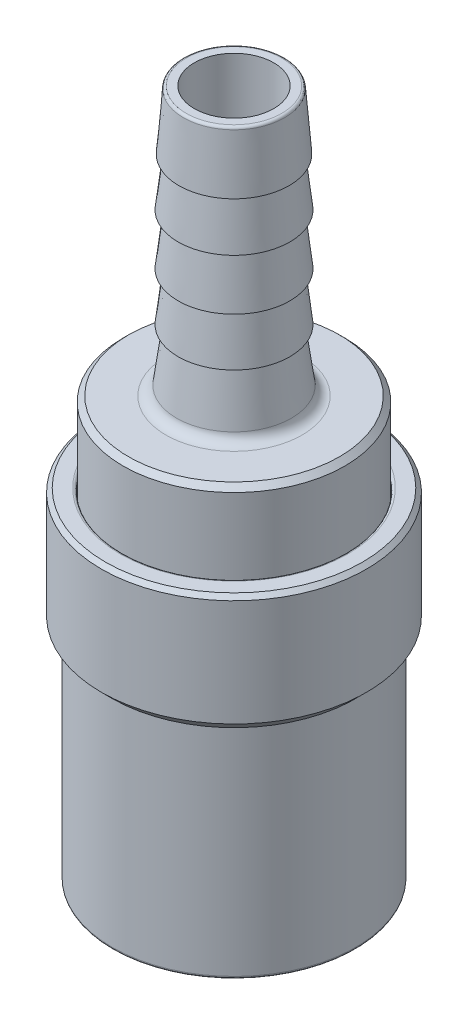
ISO-10303-21;
HEADER;
FILE_DESCRIPTION(('STEP AP214'),'2;1');
FILE_NAME('part.step','',(''),(''),'','','');
FILE_SCHEMA(('AUTOMOTIVE_DESIGN { 1 0 10303 214 1 1 1 1 }'));
ENDSEC;
DATA;
#1=APPLICATION_CONTEXT('core data for automotive mechanical design processes');
#2=APPLICATION_PROTOCOL_DEFINITION('international standard','automotive_design',2000,#1);
#3=PRODUCT_CONTEXT('',#1,'mechanical');
#4=PRODUCT('Part','Part','',(#3));
#5=PRODUCT_RELATED_PRODUCT_CATEGORY('part','',(#4));
#6=PRODUCT_DEFINITION_FORMATION('','',#4);
#7=PRODUCT_DEFINITION_CONTEXT('part definition',#1,'design');
#8=PRODUCT_DEFINITION('design','',#6,#7);
#9=PRODUCT_DEFINITION_SHAPE('','',#8);
#10=(LENGTH_UNIT() NAMED_UNIT(*) SI_UNIT(.MILLI.,.METRE.));
#11=(NAMED_UNIT(*) PLANE_ANGLE_UNIT() SI_UNIT($,.RADIAN.));
#12=(NAMED_UNIT(*) SI_UNIT($,.STERADIAN.) SOLID_ANGLE_UNIT());
#13=UNCERTAINTY_MEASURE_WITH_UNIT(LENGTH_MEASURE(1.E-05),#10,'distance_accuracy_value','');
#14=(GEOMETRIC_REPRESENTATION_CONTEXT(3) GLOBAL_UNCERTAINTY_ASSIGNED_CONTEXT((#13)) GLOBAL_UNIT_ASSIGNED_CONTEXT((#10,
#11,#12)) REPRESENTATION_CONTEXT('',''));
#15=CARTESIAN_POINT('',(0.,0.,0.));
#16=DIRECTION('',(0.,0.,1.));
#17=DIRECTION('',(1.,0.,0.));
#18=AXIS2_PLACEMENT_3D('',#15,#16,#17);
#19=CARTESIAN_POINT('',(0.,40.6908,0.));
#20=DIRECTION('',(0.,1.,0.));
#21=DIRECTION('',(0.,0.,1.));
#22=AXIS2_PLACEMENT_3D('',#19,#20,#21);
#23=TOROIDAL_SURFACE('',#22,6.43712442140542,1.016);
#24=CARTESIAN_POINT('',(0.,39.6748,0.));
#25=DIRECTION('',(0.,1.,0.));
#26=DIRECTION('',(1.,0.,0.));
#27=AXIS2_PLACEMENT_3D('',#24,#25,#26);
#28=CIRCLE('',#27,6.43712442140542);
#29=CARTESIAN_POINT('',(-6.43712442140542,39.6748,0.));
#30=VERTEX_POINT('',#29);
#31=CARTESIAN_POINT('',(0.,39.6748,-6.43712442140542));
#32=VERTEX_POINT('',#31);
#33=EDGE_CURVE('P0_E11',#30,#32,#28,.T.);
#34=ORIENTED_EDGE('',*,*,#33,.T.);
#35=CARTESIAN_POINT('',(0.,40.6908,-6.43712442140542));
#36=DIRECTION('',(-1.,0.,0.));
#37=DIRECTION('',(0.,0.,-1.));
#38=AXIS2_PLACEMENT_3D('',#35,#36,#37);
#39=CIRCLE('',#38,1.016);
#40=CARTESIAN_POINT('',(0.,40.5552920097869,-5.43020159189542));
#41=VERTEX_POINT('',#40);
#42=EDGE_CURVE('P0_E27',#32,#41,#39,.T.);
#43=ORIENTED_EDGE('',*,*,#42,.T.);
#44=CARTESIAN_POINT('',(0.,40.5552920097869,0.));
#45=DIRECTION('',(0.,-1.,0.));
#46=DIRECTION('',(1.,0.,0.));
#47=AXIS2_PLACEMENT_3D('',#44,#45,#46);
#48=CIRCLE('',#47,5.43020159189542);
#49=CARTESIAN_POINT('',(5.43020159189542,40.5552920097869,0.));
#50=VERTEX_POINT('',#49);
#51=EDGE_CURVE('P0_E257',#41,#50,#48,.T.);
#52=ORIENTED_EDGE('',*,*,#51,.T.);
#53=CARTESIAN_POINT('',(0.,40.5552920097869,0.));
#54=DIRECTION('',(0.,-1.,0.));
#55=DIRECTION('',(1.,0.,0.));
#56=AXIS2_PLACEMENT_3D('',#53,#54,#55);
#57=CIRCLE('',#56,5.43020159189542);
#58=CARTESIAN_POINT('',(-5.43020159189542,40.5552920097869,0.));
#59=VERTEX_POINT('',#58);
#60=EDGE_CURVE('P0_E250',#50,#59,#57,.T.);
#61=ORIENTED_EDGE('',*,*,#60,.T.);
#62=CARTESIAN_POINT('',(0.,40.5552920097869,0.));
#63=DIRECTION('',(0.,-1.,0.));
#64=DIRECTION('',(1.,0.,0.));
#65=AXIS2_PLACEMENT_3D('',#62,#63,#64);
#66=CIRCLE('',#65,5.43020159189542);
#67=EDGE_CURVE('P0_E255',#59,#41,#66,.T.);
#68=ORIENTED_EDGE('',*,*,#67,.T.);
#69=ORIENTED_EDGE('',*,*,#42,.F.);
#70=CARTESIAN_POINT('',(0.,39.6748,0.));
#71=DIRECTION('',(0.,1.,0.));
#72=DIRECTION('',(1.,0.,0.));
#73=AXIS2_PLACEMENT_3D('',#70,#71,#72);
#74=CIRCLE('',#73,6.43712442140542);
#75=EDGE_CURVE('P0_E265',#32,#30,#74,.T.);
#76=ORIENTED_EDGE('',*,*,#75,.T.);
#77=EDGE_LOOP('',(#34,#43,#52,#61,#68,#69,#76));
#78=FACE_BOUND('',#77,.T.);
#79=ADVANCED_FACE('P0_F16',(#78),#23,.F.);
#80=CARTESIAN_POINT('',(-5.54869498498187,39.6748,0.));
#81=DIRECTION('',(0.,1.,0.));
#82=DIRECTION('',(1.,0.,0.));
#83=AXIS2_PLACEMENT_3D('',#80,#81,#82);
#84=PLANE('',#83);
#85=CARTESIAN_POINT('',(0.,39.6748,0.));
#86=DIRECTION('',(0.,-1.,0.));
#87=DIRECTION('',(1.,0.,0.));
#88=AXIS2_PLACEMENT_3D('',#85,#86,#87);
#89=CIRCLE('',#88,9.9822);
#90=CARTESIAN_POINT('',(-9.9822,39.6748,0.));
#91=VERTEX_POINT('',#90);
#92=EDGE_CURVE('P0_E354',#91,#91,#89,.T.);
#93=ORIENTED_EDGE('',*,*,#92,.F.);
#94=EDGE_LOOP('',(#93));
#95=FACE_BOUND('',#94,.T.);
#96=ORIENTED_EDGE('',*,*,#33,.F.);
#97=ORIENTED_EDGE('',*,*,#75,.F.);
#98=EDGE_LOOP('',(#96,#97));
#99=FACE_BOUND('',#98,.T.);
#100=ADVANCED_FACE('P0_F666',(#95,#99),#84,.T.);
#101=CARTESIAN_POINT('',(0.,42.5958000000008,0.));
#102=DIRECTION('',(0.,-1.,0.));
#103=DIRECTION('',(-1.,0.,0.));
#104=AXIS2_PLACEMENT_3D('',#101,#102,#103);
#105=CONICAL_SURFACE('',#104,5.15559749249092,0.133772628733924);
#106=CARTESIAN_POINT('',(0.,45.5168000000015,0.));
#107=DIRECTION('',(0.,1.,0.));
#108=DIRECTION('',(0.,0.,1.));
#109=AXIS2_PLACEMENT_3D('',#106,#107,#108);
#110=CIRCLE('',#109,4.7625);
#111=CARTESIAN_POINT('',(-4.7625,45.5168000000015,0.));
#112=VERTEX_POINT('',#111);
#113=CARTESIAN_POINT('',(4.7625,45.5168000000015,0.));
#114=VERTEX_POINT('',#113);
#115=EDGE_CURVE('P0_E409',#112,#114,#110,.T.);
#116=ORIENTED_EDGE('',*,*,#115,.F.);
#117=CARTESIAN_POINT('',(0.,45.5168000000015,0.));
#118=DIRECTION('',(0.,1.,0.));
#119=DIRECTION('',(0.,0.,1.));
#120=AXIS2_PLACEMENT_3D('',#117,#118,#119);
#121=CIRCLE('',#120,4.7625);
#122=EDGE_CURVE('P0_E262',#114,#112,#121,.T.);
#123=ORIENTED_EDGE('',*,*,#122,.F.);
#124=DIRECTION('',(0.133374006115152,-0.991065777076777,0.));
#125=VECTOR('',#124,1.);
#126=CARTESIAN_POINT('',(5.15559749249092,42.5958000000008,0.));
#127=LINE('',#126,#125);
#128=EDGE_CURVE('P0_E254',#114,#50,#127,.T.);
#129=ORIENTED_EDGE('',*,*,#128,.T.);
#130=ORIENTED_EDGE('',*,*,#51,.F.);
#131=ORIENTED_EDGE('',*,*,#67,.F.);
#132=ORIENTED_EDGE('',*,*,#60,.F.);
#133=ORIENTED_EDGE('',*,*,#128,.F.);
#134=EDGE_LOOP('',(#116,#123,#129,#130,#131,#132,#133));
#135=FACE_BOUND('',#134,.T.);
#136=ADVANCED_FACE('P0_F252',(#135),#105,.T.);
#137=CARTESIAN_POINT('',(0.,64.8208,0.));
#138=DIRECTION('',(0.,1.,0.));
#139=DIRECTION('',(0.,0.,1.));
#140=AXIS2_PLACEMENT_3D('',#137,#138,#139);
#141=TOROIDAL_SURFACE('',#140,4.52790222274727,0.254);
#142=CARTESIAN_POINT('',(0.,65.0748,0.));
#143=DIRECTION('',(0.,-1.,0.));
#144=DIRECTION('',(1.,0.,0.));
#145=AXIS2_PLACEMENT_3D('',#142,#143,#144);
#146=CIRCLE('',#145,4.52790222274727);
#147=CARTESIAN_POINT('',(-4.52790222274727,65.0748,0.));
#148=VERTEX_POINT('',#147);
#149=CARTESIAN_POINT('',(0.,65.0748,-4.52790222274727));
#150=VERTEX_POINT('',#149);
#151=EDGE_CURVE('P0_E266',#148,#150,#146,.T.);
#152=ORIENTED_EDGE('',*,*,#151,.T.);
#153=CARTESIAN_POINT('',(0.,64.8208,-4.52790222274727));
#154=DIRECTION('',(-1.,0.,0.));
#155=DIRECTION('',(0.,0.,-1.));
#156=AXIS2_PLACEMENT_3D('',#153,#154,#155);
#157=CIRCLE('',#156,0.254);
#158=CARTESIAN_POINT('',(0.,64.8409409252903,-4.78110242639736));
#159=VERTEX_POINT('',#158);
#160=EDGE_CURVE('P0_E275',#150,#159,#157,.T.);
#161=ORIENTED_EDGE('',*,*,#160,.T.);
#162=CARTESIAN_POINT('',(0.,64.8409409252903,0.));
#163=DIRECTION('',(0.,1.,0.));
#164=DIRECTION('',(1.,0.,0.));
#165=AXIS2_PLACEMENT_3D('',#162,#163,#164);
#166=CIRCLE('',#165,4.78110242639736);
#167=CARTESIAN_POINT('',(-4.78110242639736,64.8409409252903,0.));
#168=VERTEX_POINT('',#167);
#169=EDGE_CURVE('P0_E368',#159,#168,#166,.T.);
#170=ORIENTED_EDGE('',*,*,#169,.T.);
#171=CARTESIAN_POINT('',(0.,64.8409409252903,0.));
#172=DIRECTION('',(0.,1.,0.));
#173=DIRECTION('',(1.,0.,0.));
#174=AXIS2_PLACEMENT_3D('',#171,#172,#173);
#175=CIRCLE('',#174,4.78110242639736);
#176=CARTESIAN_POINT('',(4.78110242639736,64.8409409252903,0.));
#177=VERTEX_POINT('',#176);
#178=EDGE_CURVE('P0_E364',#168,#177,#175,.T.);
#179=ORIENTED_EDGE('',*,*,#178,.T.);
#180=CARTESIAN_POINT('',(0.,64.8409409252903,0.));
#181=DIRECTION('',(0.,1.,0.));
#182=DIRECTION('',(1.,0.,0.));
#183=AXIS2_PLACEMENT_3D('',#180,#181,#182);
#184=CIRCLE('',#183,4.78110242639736);
#185=EDGE_CURVE('P0_E369',#177,#159,#184,.T.);
#186=ORIENTED_EDGE('',*,*,#185,.T.);
#187=ORIENTED_EDGE('',*,*,#160,.F.);
#188=CARTESIAN_POINT('',(0.,65.0748,0.));
#189=DIRECTION('',(0.,-1.,0.));
#190=DIRECTION('',(1.,0.,0.));
#191=AXIS2_PLACEMENT_3D('',#188,#189,#190);
#192=CIRCLE('',#191,4.52790222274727);
#193=EDGE_CURVE('P0_E392',#150,#148,#192,.T.);
#194=ORIENTED_EDGE('',*,*,#193,.T.);
#195=EDGE_LOOP('',(#152,#161,#170,#179,#186,#187,#194));
#196=FACE_BOUND('',#195,.T.);
#197=ADVANCED_FACE('P0_F660',(#196),#141,.T.);
#198=CARTESIAN_POINT('',(0.,62.2808,0.));
#199=DIRECTION('',(0.,-1.,0.));
#200=DIRECTION('',(-1.,0.,0.));
#201=AXIS2_PLACEMENT_3D('',#198,#199,#200);
#202=CONICAL_SURFACE('',#201,4.98475,0.0793783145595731);
#203=ORIENTED_EDGE('',*,*,#178,.F.);
#204=ORIENTED_EDGE('',*,*,#169,.F.);
#205=ORIENTED_EDGE('',*,*,#185,.F.);
#206=DIRECTION('',(0.0792949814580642,-0.996851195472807,0.));
#207=VECTOR('',#206,1.);
#208=CARTESIAN_POINT('',(4.98475,62.2808,0.));
#209=LINE('',#208,#207);
#210=CARTESIAN_POINT('',(5.207,59.4868,0.));
#211=VERTEX_POINT('',#210);
#212=EDGE_CURVE('P0_E362',#177,#211,#209,.T.);
#213=ORIENTED_EDGE('',*,*,#212,.T.);
#214=CARTESIAN_POINT('',(0.,59.4868,0.));
#215=DIRECTION('',(0.,1.,0.));
#216=DIRECTION('',(0.,0.,1.));
#217=AXIS2_PLACEMENT_3D('',#214,#215,#216);
#218=CIRCLE('',#217,5.207);
#219=CARTESIAN_POINT('',(-5.207,59.4868,0.));
#220=VERTEX_POINT('',#219);
#221=EDGE_CURVE('P0_E359',#211,#220,#218,.T.);
#222=ORIENTED_EDGE('',*,*,#221,.T.);
#223=CARTESIAN_POINT('',(0.,59.4868,0.));
#224=DIRECTION('',(0.,1.,0.));
#225=DIRECTION('',(0.,0.,1.));
#226=AXIS2_PLACEMENT_3D('',#223,#224,#225);
#227=CIRCLE('',#226,5.207);
#228=EDGE_CURVE('P0_E363',#220,#211,#227,.T.);
#229=ORIENTED_EDGE('',*,*,#228,.T.);
#230=ORIENTED_EDGE('',*,*,#212,.F.);
#231=EDGE_LOOP('',(#203,#204,#205,#213,#222,#229,#230));
#232=FACE_BOUND('',#231,.T.);
#233=ADVANCED_FACE('P0_F649',(#232),#202,.T.);
#234=CARTESIAN_POINT('',(-3.7592,65.0748,0.));
#235=DIRECTION('',(0.,1.,0.));
#236=DIRECTION('',(1.,0.,0.));
#237=AXIS2_PLACEMENT_3D('',#234,#235,#236);
#238=PLANE('',#237);
#239=ORIENTED_EDGE('',*,*,#151,.F.);
#240=ORIENTED_EDGE('',*,*,#193,.F.);
#241=EDGE_LOOP('',(#239,#240));
#242=FACE_BOUND('',#241,.T.);
#243=CARTESIAN_POINT('',(0.,65.0748,0.));
#244=DIRECTION('',(0.,1.,0.));
#245=DIRECTION('',(0.,0.,1.));
#246=AXIS2_PLACEMENT_3D('',#243,#244,#245);
#247=CIRCLE('',#246,3.7592);
#248=CARTESIAN_POINT('',(-3.7592,65.0748,0.));
#249=VERTEX_POINT('',#248);
#250=CARTESIAN_POINT('',(3.7592,65.0748,0.));
#251=VERTEX_POINT('',#250);
#252=EDGE_CURVE('P0_E307',#249,#251,#247,.T.);
#253=ORIENTED_EDGE('',*,*,#252,.F.);
#254=CARTESIAN_POINT('',(0.,65.0748,0.));
#255=DIRECTION('',(0.,1.,0.));
#256=DIRECTION('',(0.,0.,1.));
#257=AXIS2_PLACEMENT_3D('',#254,#255,#256);
#258=CIRCLE('',#257,3.7592);
#259=EDGE_CURVE('P0_E281',#251,#249,#258,.T.);
#260=ORIENTED_EDGE('',*,*,#259,.F.);
#261=EDGE_LOOP('',(#253,#260));
#262=FACE_BOUND('',#261,.T.);
#263=ADVANCED_FACE('P0_F646',(#242,#262),#238,.T.);
#264=CARTESIAN_POINT('',(0.,0.254,0.));
#265=DIRECTION('',(0.,1.,0.));
#266=DIRECTION('',(0.,0.,1.));
#267=AXIS2_PLACEMENT_3D('',#264,#265,#266);
#268=TOROIDAL_SURFACE('',#267,6.9977,0.254);
#269=CARTESIAN_POINT('',(0.,0.,0.));
#270=DIRECTION('',(0.,-1.,0.));
#271=DIRECTION('',(1.,0.,0.));
#272=AXIS2_PLACEMENT_3D('',#269,#270,#271);
#273=CIRCLE('',#272,6.9977);
#274=CARTESIAN_POINT('',(-6.9977,0.,0.));
#275=VERTEX_POINT('',#274);
#276=CARTESIAN_POINT('',(0.,0.,-6.9977));
#277=VERTEX_POINT('',#276);
#278=EDGE_CURVE('P0_E449',#275,#277,#273,.T.);
#279=ORIENTED_EDGE('',*,*,#278,.T.);
#280=CARTESIAN_POINT('',(0.,0.254,-6.9977));
#281=DIRECTION('',(-1.,0.,0.));
#282=DIRECTION('',(0.,0.,-1.));
#283=AXIS2_PLACEMENT_3D('',#280,#281,#282);
#284=CIRCLE('',#283,0.254);
#285=CARTESIAN_POINT('',(0.,0.254,-6.7437));
#286=VERTEX_POINT('',#285);
#287=EDGE_CURVE('P0_E445',#277,#286,#284,.T.);
#288=ORIENTED_EDGE('',*,*,#287,.T.);
#289=CARTESIAN_POINT('',(0.,0.254,0.));
#290=DIRECTION('',(0.,1.,0.));
#291=DIRECTION('',(1.,0.,0.));
#292=AXIS2_PLACEMENT_3D('',#289,#290,#291);
#293=CIRCLE('',#292,6.7437);
#294=CARTESIAN_POINT('',(-6.7437,0.254,0.));
#295=VERTEX_POINT('',#294);
#296=EDGE_CURVE('P0_E312',#286,#295,#293,.T.);
#297=ORIENTED_EDGE('',*,*,#296,.T.);
#298=CARTESIAN_POINT('',(0.,0.254,0.));
#299=DIRECTION('',(0.,1.,0.));
#300=DIRECTION('',(1.,0.,0.));
#301=AXIS2_PLACEMENT_3D('',#298,#299,#300);
#302=CIRCLE('',#301,6.7437);
#303=CARTESIAN_POINT('',(6.7437,0.254,0.));
#304=VERTEX_POINT('',#303);
#305=EDGE_CURVE('P0_E308',#295,#304,#302,.T.);
#306=ORIENTED_EDGE('',*,*,#305,.T.);
#307=CARTESIAN_POINT('',(0.,0.254,0.));
#308=DIRECTION('',(0.,1.,0.));
#309=DIRECTION('',(1.,0.,0.));
#310=AXIS2_PLACEMENT_3D('',#307,#308,#309);
#311=CIRCLE('',#310,6.7437);
#312=EDGE_CURVE('P0_E313',#304,#286,#311,.T.);
#313=ORIENTED_EDGE('',*,*,#312,.T.);
#314=ORIENTED_EDGE('',*,*,#287,.F.);
#315=CARTESIAN_POINT('',(0.,0.,0.));
#316=DIRECTION('',(0.,-1.,0.));
#317=DIRECTION('',(1.,0.,0.));
#318=AXIS2_PLACEMENT_3D('',#315,#316,#317);
#319=CIRCLE('',#318,6.9977);
#320=EDGE_CURVE('P0_E412',#277,#275,#319,.T.);
#321=ORIENTED_EDGE('',*,*,#320,.T.);
#322=EDGE_LOOP('',(#279,#288,#297,#306,#313,#314,#321));
#323=FACE_BOUND('',#322,.T.);
#324=ADVANCED_FACE('P0_F648',(#323),#268,.T.);
#325=CARTESIAN_POINT('',(-8.9535,0.,0.));
#326=DIRECTION('',(0.,-1.,0.));
#327=DIRECTION('',(0.,0.,-1.));
#328=AXIS2_PLACEMENT_3D('',#325,#326,#327);
#329=PLANE('',#328);
#330=CARTESIAN_POINT('',(0.,0.,0.));
#331=DIRECTION('',(0.,1.,0.));
#332=DIRECTION('',(1.,0.,0.));
#333=AXIS2_PLACEMENT_3D('',#330,#331,#332);
#334=CIRCLE('',#333,8.6995);
#335=CARTESIAN_POINT('',(-8.6995,0.,0.));
#336=VERTEX_POINT('',#335);
#337=CARTESIAN_POINT('',(0.,0.,-8.6995));
#338=VERTEX_POINT('',#337);
#339=EDGE_CURVE('P0_E346',#336,#338,#334,.T.);
#340=ORIENTED_EDGE('',*,*,#339,.F.);
#341=CARTESIAN_POINT('',(0.,0.,0.));
#342=DIRECTION('',(0.,1.,0.));
#343=DIRECTION('',(1.,0.,0.));
#344=AXIS2_PLACEMENT_3D('',#341,#342,#343);
#345=CIRCLE('',#344,8.6995);
#346=EDGE_CURVE('P0_E376',#338,#336,#345,.T.);
#347=ORIENTED_EDGE('',*,*,#346,.F.);
#348=EDGE_LOOP('',(#340,#347));
#349=FACE_BOUND('',#348,.T.);
#350=ORIENTED_EDGE('',*,*,#278,.F.);
#351=ORIENTED_EDGE('',*,*,#320,.F.);
#352=EDGE_LOOP('',(#350,#351));
#353=FACE_BOUND('',#352,.T.);
#354=ADVANCED_FACE('P0_F657',(#349,#353),#329,.T.);
#355=CARTESIAN_POINT('',(0.,6.5396999,0.));
#356=DIRECTION('',(0.,1.,0.));
#357=DIRECTION('',(-1.,0.,0.));
#358=AXIS2_PLACEMENT_3D('',#355,#356,#357);
#359=CYLINDRICAL_SURFACE('',#358,6.7437);
#360=CARTESIAN_POINT('',(0.,13.0793998,0.));
#361=DIRECTION('',(0.,1.,0.));
#362=DIRECTION('',(0.,0.,1.));
#363=AXIS2_PLACEMENT_3D('',#360,#361,#362);
#364=CIRCLE('',#363,6.7437);
#365=CARTESIAN_POINT('',(-6.7437,13.0793998,0.));
#366=VERTEX_POINT('',#365);
#367=CARTESIAN_POINT('',(6.7437,13.0793998,0.));
#368=VERTEX_POINT('',#367);
#369=EDGE_CURVE('P0_E416',#366,#368,#364,.T.);
#370=ORIENTED_EDGE('',*,*,#369,.T.);
#371=DIRECTION('',(0.,-1.,0.));
#372=VECTOR('',#371,1.);
#373=CARTESIAN_POINT('',(6.7437,6.5396999,0.));
#374=LINE('',#373,#372);
#375=EDGE_CURVE('P0_E321',#368,#304,#374,.T.);
#376=ORIENTED_EDGE('',*,*,#375,.T.);
#377=ORIENTED_EDGE('',*,*,#305,.F.);
#378=ORIENTED_EDGE('',*,*,#296,.F.);
#379=ORIENTED_EDGE('',*,*,#312,.F.);
#380=ORIENTED_EDGE('',*,*,#375,.F.);
#381=CARTESIAN_POINT('',(0.,13.0793998,0.));
#382=DIRECTION('',(0.,1.,0.));
#383=DIRECTION('',(0.,0.,1.));
#384=AXIS2_PLACEMENT_3D('',#381,#382,#383);
#385=CIRCLE('',#384,6.7437);
#386=EDGE_CURVE('P0_E317',#368,#366,#385,.T.);
#387=ORIENTED_EDGE('',*,*,#386,.T.);
#388=EDGE_LOOP('',(#370,#376,#377,#378,#379,#380,#387));
#389=FACE_BOUND('',#388,.T.);
#390=ADVANCED_FACE('P0_F690',(#389),#359,.F.);
#391=CARTESIAN_POINT('',(0.,0.254,0.));
#392=DIRECTION('',(0.,1.,0.));
#393=DIRECTION('',(0.,0.,1.));
#394=AXIS2_PLACEMENT_3D('',#391,#392,#393);
#395=TOROIDAL_SURFACE('',#394,8.6995,0.254);
#396=CARTESIAN_POINT('',(0.,0.254,0.));
#397=DIRECTION('',(0.,-1.,0.));
#398=DIRECTION('',(1.,0.,0.));
#399=AXIS2_PLACEMENT_3D('',#396,#397,#398);
#400=CIRCLE('',#399,8.9535);
#401=CARTESIAN_POINT('',(-8.9535,0.254,0.));
#402=VERTEX_POINT('',#401);
#403=CARTESIAN_POINT('',(0.,0.254,-8.9535));
#404=VERTEX_POINT('',#403);
#405=EDGE_CURVE('P0_E322',#402,#404,#400,.T.);
#406=ORIENTED_EDGE('',*,*,#405,.T.);
#407=CARTESIAN_POINT('',(0.,0.254,-8.6995));
#408=DIRECTION('',(-1.,0.,0.));
#409=DIRECTION('',(0.,0.,-1.));
#410=AXIS2_PLACEMENT_3D('',#407,#408,#409);
#411=CIRCLE('',#410,0.254);
#412=EDGE_CURVE('P0_E341',#404,#338,#411,.T.);
#413=ORIENTED_EDGE('',*,*,#412,.T.);
#414=ORIENTED_EDGE('',*,*,#346,.T.);
#415=ORIENTED_EDGE('',*,*,#339,.T.);
#416=ORIENTED_EDGE('',*,*,#412,.F.);
#417=CARTESIAN_POINT('',(0.,0.254,0.));
#418=DIRECTION('',(0.,-1.,0.));
#419=DIRECTION('',(1.,0.,0.));
#420=AXIS2_PLACEMENT_3D('',#417,#418,#419);
#421=CIRCLE('',#420,8.9535);
#422=CARTESIAN_POINT('',(8.9535,0.254,0.));
#423=VERTEX_POINT('',#422);
#424=EDGE_CURVE('P0_E342',#404,#423,#421,.T.);
#425=ORIENTED_EDGE('',*,*,#424,.T.);
#426=CARTESIAN_POINT('',(0.,0.254,0.));
#427=DIRECTION('',(0.,-1.,0.));
#428=DIRECTION('',(1.,0.,0.));
#429=AXIS2_PLACEMENT_3D('',#426,#427,#428);
#430=CIRCLE('',#429,8.9535);
#431=EDGE_CURVE('P0_E347',#423,#402,#430,.T.);
#432=ORIENTED_EDGE('',*,*,#431,.T.);
#433=EDGE_LOOP('',(#406,#413,#414,#415,#416,#425,#432));
#434=FACE_BOUND('',#433,.T.);
#435=ADVANCED_FACE('P0_F686',(#434),#395,.T.);
#436=CARTESIAN_POINT('',(0.,8.89,0.));
#437=DIRECTION('',(0.,1.,0.));
#438=DIRECTION('',(-1.,0.,0.));
#439=AXIS2_PLACEMENT_3D('',#436,#437,#438);
#440=CYLINDRICAL_SURFACE('',#439,8.9535);
#441=CARTESIAN_POINT('',(0.,17.78,0.));
#442=DIRECTION('',(0.,1.,0.));
#443=DIRECTION('',(0.,0.,1.));
#444=AXIS2_PLACEMENT_3D('',#441,#442,#443);
#445=CIRCLE('',#444,8.9535);
#446=CARTESIAN_POINT('',(-8.9535,17.78,0.));
#447=VERTEX_POINT('',#446);
#448=CARTESIAN_POINT('',(8.9535,17.78,0.));
#449=VERTEX_POINT('',#448);
#450=EDGE_CURVE('P0_E455',#447,#449,#445,.T.);
#451=ORIENTED_EDGE('',*,*,#450,.F.);
#452=CARTESIAN_POINT('',(0.,17.78,0.));
#453=DIRECTION('',(0.,1.,0.));
#454=DIRECTION('',(0.,0.,1.));
#455=AXIS2_PLACEMENT_3D('',#452,#453,#454);
#456=CIRCLE('',#455,8.9535);
#457=EDGE_CURVE('P0_E358',#449,#447,#456,.T.);
#458=ORIENTED_EDGE('',*,*,#457,.F.);
#459=DIRECTION('',(0.,-1.,0.));
#460=VECTOR('',#459,1.);
#461=CARTESIAN_POINT('',(8.9535,8.89,0.));
#462=LINE('',#461,#460);
#463=EDGE_CURVE('P0_E372',#449,#423,#462,.T.);
#464=ORIENTED_EDGE('',*,*,#463,.T.);
#465=ORIENTED_EDGE('',*,*,#424,.F.);
#466=ORIENTED_EDGE('',*,*,#405,.F.);
#467=ORIENTED_EDGE('',*,*,#431,.F.);
#468=ORIENTED_EDGE('',*,*,#463,.F.);
#469=EDGE_LOOP('',(#451,#458,#464,#465,#466,#467,#468));
#470=FACE_BOUND('',#469,.T.);
#471=ADVANCED_FACE('P0_F689',(#470),#440,.T.);
#472=CARTESIAN_POINT('',(0.,18.034,0.));
#473=DIRECTION('',(0.,1.,0.));
#474=DIRECTION('',(0.,0.,1.));
#475=AXIS2_PLACEMENT_3D('',#472,#473,#474);
#476=TOROIDAL_SURFACE('',#475,10.2362,0.254);
#477=CARTESIAN_POINT('',(0.,18.034,0.));
#478=DIRECTION('',(0.,-1.,0.));
#479=DIRECTION('',(1.,0.,0.));
#480=AXIS2_PLACEMENT_3D('',#477,#478,#479);
#481=CIRCLE('',#480,10.4902);
#482=CARTESIAN_POINT('',(-10.4902,18.034,0.));
#483=VERTEX_POINT('',#482);
#484=CARTESIAN_POINT('',(0.,18.034,-10.4902));
#485=VERTEX_POINT('',#484);
#486=EDGE_CURVE('P0_E462',#483,#485,#481,.T.);
#487=ORIENTED_EDGE('',*,*,#486,.T.);
#488=CARTESIAN_POINT('',(0.,18.034,-10.2362));
#489=DIRECTION('',(-1.,0.,0.));
#490=DIRECTION('',(0.,0.,-1.));
#491=AXIS2_PLACEMENT_3D('',#488,#489,#490);
#492=CIRCLE('',#491,0.254);
#493=CARTESIAN_POINT('',(0.,17.78,-10.2362));
#494=VERTEX_POINT('',#493);
#495=EDGE_CURVE('P0_E466',#485,#494,#492,.T.);
#496=ORIENTED_EDGE('',*,*,#495,.T.);
#497=CARTESIAN_POINT('',(0.,17.78,0.));
#498=DIRECTION('',(0.,1.,0.));
#499=DIRECTION('',(1.,0.,0.));
#500=AXIS2_PLACEMENT_3D('',#497,#498,#499);
#501=CIRCLE('',#500,10.2362);
#502=CARTESIAN_POINT('',(-10.2362,17.78,0.));
#503=VERTEX_POINT('',#502);
#504=EDGE_CURVE('P0_E291',#494,#503,#501,.T.);
#505=ORIENTED_EDGE('',*,*,#504,.T.);
#506=CARTESIAN_POINT('',(0.,17.78,0.));
#507=DIRECTION('',(0.,1.,0.));
#508=DIRECTION('',(1.,0.,0.));
#509=AXIS2_PLACEMENT_3D('',#506,#507,#508);
#510=CIRCLE('',#509,10.2362);
#511=EDGE_CURVE('P0_E287',#503,#494,#510,.T.);
#512=ORIENTED_EDGE('',*,*,#511,.T.);
#513=ORIENTED_EDGE('',*,*,#495,.F.);
#514=CARTESIAN_POINT('',(0.,18.034,0.));
#515=DIRECTION('',(0.,-1.,0.));
#516=DIRECTION('',(1.,0.,0.));
#517=AXIS2_PLACEMENT_3D('',#514,#515,#516);
#518=CIRCLE('',#517,10.4902);
#519=CARTESIAN_POINT('',(10.4902,18.034,0.));
#520=VERTEX_POINT('',#519);
#521=EDGE_CURVE('P0_E292',#485,#520,#518,.T.);
#522=ORIENTED_EDGE('',*,*,#521,.T.);
#523=CARTESIAN_POINT('',(0.,18.034,0.));
#524=DIRECTION('',(0.,-1.,0.));
#525=DIRECTION('',(1.,0.,0.));
#526=AXIS2_PLACEMENT_3D('',#523,#524,#525);
#527=CIRCLE('',#526,10.4902);
#528=EDGE_CURVE('P0_E337',#520,#483,#527,.T.);
#529=ORIENTED_EDGE('',*,*,#528,.T.);
#530=EDGE_LOOP('',(#487,#496,#505,#512,#513,#522,#529));
#531=FACE_BOUND('',#530,.T.);
#532=ADVANCED_FACE('P0_F18',(#531),#476,.T.);
#533=CARTESIAN_POINT('',(0.,28.7274,0.));
#534=DIRECTION('',(0.,1.,0.));
#535=DIRECTION('',(-1.,0.,0.));
#536=AXIS2_PLACEMENT_3D('',#533,#534,#535);
#537=CYLINDRICAL_SURFACE('',#536,10.4902);
#538=CARTESIAN_POINT('',(0.,39.1668,0.));
#539=DIRECTION('',(0.,1.,0.));
#540=DIRECTION('',(1.,0.,0.));
#541=AXIS2_PLACEMENT_3D('',#538,#539,#540);
#542=CIRCLE('',#541,10.4902);
#543=CARTESIAN_POINT('',(-10.4902,39.1668,0.));
#544=VERTEX_POINT('',#543);
#545=CARTESIAN_POINT('',(10.4902,39.1668,0.));
#546=VERTEX_POINT('',#545);
#547=EDGE_CURVE('P0_E293',#544,#546,#542,.T.);
#548=ORIENTED_EDGE('',*,*,#547,.F.);
#549=CARTESIAN_POINT('',(0.,39.1668,0.));
#550=DIRECTION('',(0.,1.,0.));
#551=DIRECTION('',(1.,0.,0.));
#552=AXIS2_PLACEMENT_3D('',#549,#550,#551);
#553=CIRCLE('',#552,10.4902);
#554=EDGE_CURVE('P0_E297',#546,#544,#553,.T.);
#555=ORIENTED_EDGE('',*,*,#554,.F.);
#556=DIRECTION('',(0.,-1.,0.));
#557=VECTOR('',#556,1.);
#558=CARTESIAN_POINT('',(10.4902,28.7274,0.));
#559=LINE('',#558,#557);
#560=EDGE_CURVE('P0_E399',#546,#520,#559,.T.);
#561=ORIENTED_EDGE('',*,*,#560,.T.);
#562=ORIENTED_EDGE('',*,*,#521,.F.);
#563=ORIENTED_EDGE('',*,*,#486,.F.);
#564=ORIENTED_EDGE('',*,*,#528,.F.);
#565=ORIENTED_EDGE('',*,*,#560,.F.);
#566=EDGE_LOOP('',(#548,#555,#561,#562,#563,#564,#565));
#567=FACE_BOUND('',#566,.T.);
#568=ADVANCED_FACE('P0_F681',(#567),#537,.T.);
#569=CARTESIAN_POINT('',(-10.4902,17.78,0.));
#570=DIRECTION('',(0.,-1.,0.));
#571=DIRECTION('',(0.,0.,-1.));
#572=AXIS2_PLACEMENT_3D('',#569,#570,#571);
#573=PLANE('',#572);
#574=ORIENTED_EDGE('',*,*,#511,.F.);
#575=ORIENTED_EDGE('',*,*,#504,.F.);
#576=EDGE_LOOP('',(#574,#575));
#577=FACE_BOUND('',#576,.T.);
#578=ORIENTED_EDGE('',*,*,#450,.T.);
#579=ORIENTED_EDGE('',*,*,#457,.T.);
#580=EDGE_LOOP('',(#578,#579));
#581=FACE_BOUND('',#580,.T.);
#582=ADVANCED_FACE('P0_F677',(#577,#581),#573,.T.);
#583=CARTESIAN_POINT('',(0.,39.4208,0.));
#584=DIRECTION('',(0.,-1.,0.));
#585=DIRECTION('',(1.,0.,0.));
#586=AXIS2_PLACEMENT_3D('',#583,#584,#585);
#587=CONICAL_SURFACE('',#586,10.2362,0.785398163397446);
#588=ORIENTED_EDGE('',*,*,#92,.T.);
#589=DIRECTION('',(-0.707106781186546,-0.707106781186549,0.));
#590=VECTOR('',#589,1.);
#591=CARTESIAN_POINT('',(-10.2362,39.4208,0.));
#592=LINE('',#591,#590);
#593=EDGE_CURVE('P0_E20',#91,#544,#592,.T.);
#594=ORIENTED_EDGE('',*,*,#593,.T.);
#595=ORIENTED_EDGE('',*,*,#547,.T.);
#596=ORIENTED_EDGE('',*,*,#554,.T.);
#597=ORIENTED_EDGE('',*,*,#593,.F.);
#598=EDGE_LOOP('',(#588,#594,#595,#596,#597));
#599=FACE_BOUND('',#598,.T.);
#600=ADVANCED_FACE('P0_F680',(#599),#587,.T.);
#601=CARTESIAN_POINT('',(0.,14.3562822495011,0.));
#602=DIRECTION('',(0.,1.,0.));
#603=DIRECTION('',(-1.,0.,0.));
#604=AXIS2_PLACEMENT_3D('',#601,#602,#603);
#605=CONICAL_SURFACE('',#604,7.10509565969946,0.0227391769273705);
#606=CARTESIAN_POINT('',(0.,15.3085360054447,0.));
#607=DIRECTION('',(0.,1.,0.));
#608=DIRECTION('',(0.,0.,1.));
#609=AXIS2_PLACEMENT_3D('',#606,#607,#608);
#610=CIRCLE('',#609,7.12675285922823);
#611=CARTESIAN_POINT('',(-7.12675285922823,15.3085360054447,0.));
#612=VERTEX_POINT('',#611);
#613=CARTESIAN_POINT('',(7.12675285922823,15.3085360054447,0.));
#614=VERTEX_POINT('',#613);
#615=EDGE_CURVE('P0_E316',#612,#614,#610,.T.);
#616=ORIENTED_EDGE('',*,*,#615,.T.);
#617=DIRECTION('',(-0.0227372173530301,-0.999741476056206,0.));
#618=VECTOR('',#617,1.);
#619=CARTESIAN_POINT('',(7.10509565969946,14.3562822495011,0.));
#620=LINE('',#619,#618);
#621=CARTESIAN_POINT('',(7.08343846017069,13.4040284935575,0.));
#622=VERTEX_POINT('',#621);
#623=EDGE_CURVE('P0_E381',#614,#622,#620,.T.);
#624=ORIENTED_EDGE('',*,*,#623,.T.);
#625=CARTESIAN_POINT('',(0.,13.4040284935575,0.));
#626=DIRECTION('',(0.,1.,0.));
#627=DIRECTION('',(0.,0.,1.));
#628=AXIS2_PLACEMENT_3D('',#625,#626,#627);
#629=CIRCLE('',#628,7.08343846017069);
#630=CARTESIAN_POINT('',(-7.08343846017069,13.4040284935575,0.));
#631=VERTEX_POINT('',#630);
#632=EDGE_CURVE('P0_E332',#631,#622,#629,.T.);
#633=ORIENTED_EDGE('',*,*,#632,.F.);
#634=CARTESIAN_POINT('',(0.,13.4040284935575,0.));
#635=DIRECTION('',(0.,1.,0.));
#636=DIRECTION('',(0.,0.,1.));
#637=AXIS2_PLACEMENT_3D('',#634,#635,#636);
#638=CIRCLE('',#637,7.08343846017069);
#639=EDGE_CURVE('P0_E333',#622,#631,#638,.T.);
#640=ORIENTED_EDGE('',*,*,#639,.F.);
#641=ORIENTED_EDGE('',*,*,#623,.F.);
#642=CARTESIAN_POINT('',(0.,15.3085360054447,0.));
#643=DIRECTION('',(0.,1.,0.));
#644=DIRECTION('',(0.,0.,1.));
#645=AXIS2_PLACEMENT_3D('',#642,#643,#644);
#646=CIRCLE('',#645,7.12675285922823);
#647=EDGE_CURVE('P0_E377',#614,#612,#646,.T.);
#648=ORIENTED_EDGE('',*,*,#647,.T.);
#649=EDGE_LOOP('',(#616,#624,#633,#640,#641,#648));
#650=FACE_BOUND('',#649,.T.);
#651=ADVANCED_FACE('P0_F692',(#650),#605,.F.);
#652=CARTESIAN_POINT('',(0.,13.2417141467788,0.));
#653=DIRECTION('',(0.,1.,0.));
#654=DIRECTION('',(-1.,0.,0.));
#655=AXIS2_PLACEMENT_3D('',#652,#653,#654);
#656=CONICAL_SURFACE('',#655,6.91356923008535,0.808137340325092);
#657=ORIENTED_EDGE('',*,*,#632,.T.);
#658=DIRECTION('',(-0.72300161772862,-0.690846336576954,0.));
#659=VECTOR('',#658,1.);
#660=CARTESIAN_POINT('',(6.91356923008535,13.2417141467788,0.));
#661=LINE('',#660,#659);
#662=EDGE_CURVE('P0_E328',#622,#368,#661,.T.);
#663=ORIENTED_EDGE('',*,*,#662,.T.);
#664=ORIENTED_EDGE('',*,*,#369,.F.);
#665=ORIENTED_EDGE('',*,*,#386,.F.);
#666=ORIENTED_EDGE('',*,*,#662,.F.);
#667=ORIENTED_EDGE('',*,*,#639,.T.);
#668=EDGE_LOOP('',(#657,#663,#664,#665,#666,#667));
#669=FACE_BOUND('',#668,.T.);
#670=ADVANCED_FACE('P0_F695',(#669),#656,.F.);
#671=CARTESIAN_POINT('',(-5.2832,45.5168000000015,0.));
#672=DIRECTION('',(0.,-1.,0.));
#673=DIRECTION('',(0.,0.,-1.));
#674=AXIS2_PLACEMENT_3D('',#671,#672,#673);
#675=PLANE('',#674);
#676=CARTESIAN_POINT('',(0.,45.5168000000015,0.));
#677=DIRECTION('',(0.,1.,0.));
#678=DIRECTION('',(0.,0.,1.));
#679=AXIS2_PLACEMENT_3D('',#676,#677,#678);
#680=CIRCLE('',#679,5.2832);
#681=CARTESIAN_POINT('',(-5.2832,45.5168000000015,0.));
#682=VERTEX_POINT('',#681);
#683=CARTESIAN_POINT('',(5.2832,45.5168000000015,0.));
#684=VERTEX_POINT('',#683);
#685=EDGE_CURVE('P0_E427',#682,#684,#680,.T.);
#686=ORIENTED_EDGE('',*,*,#685,.F.);
#687=CARTESIAN_POINT('',(0.,45.5168000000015,0.));
#688=DIRECTION('',(0.,1.,0.));
#689=DIRECTION('',(0.,0.,1.));
#690=AXIS2_PLACEMENT_3D('',#687,#688,#689);
#691=CIRCLE('',#690,5.2832);
#692=EDGE_CURVE('P0_E444',#684,#682,#691,.T.);
#693=ORIENTED_EDGE('',*,*,#692,.F.);
#694=EDGE_LOOP('',(#686,#693));
#695=FACE_BOUND('',#694,.T.);
#696=ORIENTED_EDGE('',*,*,#115,.T.);
#697=ORIENTED_EDGE('',*,*,#122,.T.);
#698=EDGE_LOOP('',(#696,#697));
#699=FACE_BOUND('',#698,.T.);
#700=ADVANCED_FACE('P0_F828',(#695,#699),#675,.T.);
#701=CARTESIAN_POINT('',(0.,47.8028000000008,0.));
#702=DIRECTION('',(0.,-1.,0.));
#703=DIRECTION('',(-1.,0.,0.));
#704=AXIS2_PLACEMENT_3D('',#701,#702,#703);
#705=CONICAL_SURFACE('',#704,5.02285,0.113400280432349);
#706=CARTESIAN_POINT('',(0.,50.0888,0.));
#707=DIRECTION('',(0.,1.,0.));
#708=DIRECTION('',(0.,0.,1.));
#709=AXIS2_PLACEMENT_3D('',#706,#707,#708);
#710=CIRCLE('',#709,4.7625);
#711=CARTESIAN_POINT('',(-4.7625,50.0888,0.));
#712=VERTEX_POINT('',#711);
#713=CARTESIAN_POINT('',(4.7625,50.0888,0.));
#714=VERTEX_POINT('',#713);
#715=EDGE_CURVE('P0_E423',#712,#714,#710,.T.);
#716=ORIENTED_EDGE('',*,*,#715,.F.);
#717=CARTESIAN_POINT('',(0.,50.0888,0.));
#718=DIRECTION('',(0.,1.,0.));
#719=DIRECTION('',(0.,0.,1.));
#720=AXIS2_PLACEMENT_3D('',#717,#718,#719);
#721=CIRCLE('',#720,4.7625);
#722=EDGE_CURVE('P0_E428',#714,#712,#721,.T.);
#723=ORIENTED_EDGE('',*,*,#722,.F.);
#724=DIRECTION('',(0.113157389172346,-0.993577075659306,0.));
#725=VECTOR('',#724,1.);
#726=CARTESIAN_POINT('',(5.02285,47.8028000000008,0.));
#727=LINE('',#726,#725);
#728=EDGE_CURVE('P0_E410',#714,#684,#727,.T.);
#729=ORIENTED_EDGE('',*,*,#728,.T.);
#730=ORIENTED_EDGE('',*,*,#692,.T.);
#731=ORIENTED_EDGE('',*,*,#685,.T.);
#732=ORIENTED_EDGE('',*,*,#728,.F.);
#733=EDGE_LOOP('',(#716,#723,#729,#730,#731,#732));
#734=FACE_BOUND('',#733,.T.);
#735=ADVANCED_FACE('P0_F675',(#734),#705,.T.);
#736=CARTESIAN_POINT('',(-5.2832,50.0888000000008,0.));
#737=DIRECTION('',(0.,-1.,0.));
#738=DIRECTION('',(0.,0.,-1.));
#739=AXIS2_PLACEMENT_3D('',#736,#737,#738);
#740=PLANE('',#739);
#741=CARTESIAN_POINT('',(0.,50.0888000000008,0.));
#742=DIRECTION('',(0.,1.,0.));
#743=DIRECTION('',(0.,0.,1.));
#744=AXIS2_PLACEMENT_3D('',#741,#742,#743);
#745=CIRCLE('',#744,5.2832);
#746=CARTESIAN_POINT('',(-5.2832,50.0888000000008,0.));
#747=VERTEX_POINT('',#746);
#748=CARTESIAN_POINT('',(5.2832,50.0888000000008,0.));
#749=VERTEX_POINT('',#748);
#750=EDGE_CURVE('P0_E422',#747,#749,#745,.T.);
#751=ORIENTED_EDGE('',*,*,#750,.F.);
#752=CARTESIAN_POINT('',(0.,50.0888000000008,0.));
#753=DIRECTION('',(0.,1.,0.));
#754=DIRECTION('',(0.,0.,1.));
#755=AXIS2_PLACEMENT_3D('',#752,#753,#754);
#756=CIRCLE('',#755,5.2832);
#757=EDGE_CURVE('P0_E417',#749,#747,#756,.T.);
#758=ORIENTED_EDGE('',*,*,#757,.F.);
#759=EDGE_LOOP('',(#751,#758));
#760=FACE_BOUND('',#759,.T.);
#761=ORIENTED_EDGE('',*,*,#715,.T.);
#762=ORIENTED_EDGE('',*,*,#722,.T.);
#763=EDGE_LOOP('',(#761,#762));
#764=FACE_BOUND('',#763,.T.);
#765=ADVANCED_FACE('P0_F849',(#760,#764),#740,.T.);
#766=CARTESIAN_POINT('',(0.,52.5018,0.));
#767=DIRECTION('',(0.,-1.,0.));
#768=DIRECTION('',(-1.,0.,0.));
#769=AXIS2_PLACEMENT_3D('',#766,#767,#768);
#770=CONICAL_SURFACE('',#769,5.00838611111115,0.113400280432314);
#771=CARTESIAN_POINT('',(0.,54.9148,0.));
#772=DIRECTION('',(0.,1.,0.));
#773=DIRECTION('',(0.,0.,1.));
#774=AXIS2_PLACEMENT_3D('',#771,#772,#773);
#775=CIRCLE('',#774,4.7335722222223);
#776=CARTESIAN_POINT('',(-4.7335722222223,54.9148,0.));
#777=VERTEX_POINT('',#776);
#778=CARTESIAN_POINT('',(4.7335722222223,54.9148,0.));
#779=VERTEX_POINT('',#778);
#780=EDGE_CURVE('P0_E518',#777,#779,#775,.T.);
#781=ORIENTED_EDGE('',*,*,#780,.F.);
#782=CARTESIAN_POINT('',(0.,54.9148,0.));
#783=DIRECTION('',(0.,1.,0.));
#784=DIRECTION('',(0.,0.,1.));
#785=AXIS2_PLACEMENT_3D('',#782,#783,#784);
#786=CIRCLE('',#785,4.7335722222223);
#787=EDGE_CURVE('P0_E522',#779,#777,#786,.T.);
#788=ORIENTED_EDGE('',*,*,#787,.F.);
#789=DIRECTION('',(0.113157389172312,-0.99357707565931,0.));
#790=VECTOR('',#789,1.);
#791=CARTESIAN_POINT('',(5.00838611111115,52.5018,0.));
#792=LINE('',#791,#790);
#793=EDGE_CURVE('P0_E421',#779,#749,#792,.T.);
#794=ORIENTED_EDGE('',*,*,#793,.T.);
#795=ORIENTED_EDGE('',*,*,#757,.T.);
#796=ORIENTED_EDGE('',*,*,#750,.T.);
#797=ORIENTED_EDGE('',*,*,#793,.F.);
#798=EDGE_LOOP('',(#781,#788,#794,#795,#796,#797));
#799=FACE_BOUND('',#798,.T.);
#800=ADVANCED_FACE('P0_F859',(#799),#770,.T.);
#801=CARTESIAN_POINT('',(-5.2832,54.9148,0.));
#802=DIRECTION('',(0.,-1.,0.));
#803=DIRECTION('',(0.,0.,-1.));
#804=AXIS2_PLACEMENT_3D('',#801,#802,#803);
#805=PLANE('',#804);
#806=CARTESIAN_POINT('',(0.,54.9148,0.));
#807=DIRECTION('',(0.,1.,0.));
#808=DIRECTION('',(0.,0.,1.));
#809=AXIS2_PLACEMENT_3D('',#806,#807,#808);
#810=CIRCLE('',#809,5.2832);
#811=CARTESIAN_POINT('',(-5.2832,54.9148,0.));
#812=VERTEX_POINT('',#811);
#813=CARTESIAN_POINT('',(5.2832,54.9148,0.));
#814=VERTEX_POINT('',#813);
#815=EDGE_CURVE('P0_E352',#812,#814,#810,.T.);
#816=ORIENTED_EDGE('',*,*,#815,.F.);
#817=CARTESIAN_POINT('',(0.,54.9148,0.));
#818=DIRECTION('',(0.,1.,0.));
#819=DIRECTION('',(0.,0.,1.));
#820=AXIS2_PLACEMENT_3D('',#817,#818,#819);
#821=CIRCLE('',#820,5.2832);
#822=EDGE_CURVE('P0_E467',#814,#812,#821,.T.);
#823=ORIENTED_EDGE('',*,*,#822,.F.);
#824=EDGE_LOOP('',(#816,#823));
#825=FACE_BOUND('',#824,.T.);
#826=ORIENTED_EDGE('',*,*,#780,.T.);
#827=ORIENTED_EDGE('',*,*,#787,.T.);
#828=EDGE_LOOP('',(#826,#827));
#829=FACE_BOUND('',#828,.T.);
#830=ADVANCED_FACE('P0_F870',(#825,#829),#805,.T.);
#831=CARTESIAN_POINT('',(0.,57.2008,0.));
#832=DIRECTION('',(0.,-1.,0.));
#833=DIRECTION('',(-1.,0.,0.));
#834=AXIS2_PLACEMENT_3D('',#831,#832,#833);
#835=CONICAL_SURFACE('',#834,5.02285,0.113400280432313);
#836=CARTESIAN_POINT('',(0.,59.4868,0.));
#837=DIRECTION('',(0.,1.,0.));
#838=DIRECTION('',(0.,0.,1.));
#839=AXIS2_PLACEMENT_3D('',#836,#837,#838);
#840=CIRCLE('',#839,4.7625);
#841=CARTESIAN_POINT('',(-4.7625,59.4868,0.));
#842=VERTEX_POINT('',#841);
#843=CARTESIAN_POINT('',(4.7625,59.4868,0.));
#844=VERTEX_POINT('',#843);
#845=EDGE_CURVE('P0_E348',#842,#844,#840,.T.);
#846=ORIENTED_EDGE('',*,*,#845,.F.);
#847=CARTESIAN_POINT('',(0.,59.4868,0.));
#848=DIRECTION('',(0.,1.,0.));
#849=DIRECTION('',(0.,0.,1.));
#850=AXIS2_PLACEMENT_3D('',#847,#848,#849);
#851=CIRCLE('',#850,4.7625);
#852=EDGE_CURVE('P0_E353',#844,#842,#851,.T.);
#853=ORIENTED_EDGE('',*,*,#852,.F.);
#854=DIRECTION('',(0.11315738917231,-0.99357707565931,0.));
#855=VECTOR('',#854,1.);
#856=CARTESIAN_POINT('',(5.02285,57.2008,0.));
#857=LINE('',#856,#855);
#858=EDGE_CURVE('P0_E471',#844,#814,#857,.T.);
#859=ORIENTED_EDGE('',*,*,#858,.T.);
#860=ORIENTED_EDGE('',*,*,#822,.T.);
#861=ORIENTED_EDGE('',*,*,#815,.T.);
#862=ORIENTED_EDGE('',*,*,#858,.F.);
#863=EDGE_LOOP('',(#846,#853,#859,#860,#861,#862));
#864=FACE_BOUND('',#863,.T.);
#865=ADVANCED_FACE('P0_F881',(#864),#835,.T.);
#866=CARTESIAN_POINT('',(-5.207,59.4868,0.));
#867=DIRECTION('',(0.,-1.,0.));
#868=DIRECTION('',(0.,0.,-1.));
#869=AXIS2_PLACEMENT_3D('',#866,#867,#868);
#870=PLANE('',#869);
#871=ORIENTED_EDGE('',*,*,#228,.F.);
#872=ORIENTED_EDGE('',*,*,#221,.F.);
#873=EDGE_LOOP('',(#871,#872));
#874=FACE_BOUND('',#873,.T.);
#875=ORIENTED_EDGE('',*,*,#845,.T.);
#876=ORIENTED_EDGE('',*,*,#852,.T.);
#877=EDGE_LOOP('',(#875,#876));
#878=FACE_BOUND('',#877,.T.);
#879=ADVANCED_FACE('P0_F702',(#874,#878),#870,.T.);
#880=CARTESIAN_POINT('',(0.,48.4124005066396,0.));
#881=DIRECTION('',(0.,1.,0.));
#882=DIRECTION('',(-1.,0.,0.));
#883=AXIS2_PLACEMENT_3D('',#880,#881,#882);
#884=CYLINDRICAL_SURFACE('',#883,3.7592);
#885=ORIENTED_EDGE('',*,*,#252,.T.);
#886=DIRECTION('',(0.,-1.,0.));
#887=VECTOR('',#886,1.);
#888=CARTESIAN_POINT('',(3.7592,48.4124005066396,0.));
#889=LINE('',#888,#887);
#890=CARTESIAN_POINT('',(3.7592,31.7500010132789,0.));
#891=VERTEX_POINT('',#890);
#892=EDGE_CURVE('P0_E285',#251,#891,#889,.T.);
#893=ORIENTED_EDGE('',*,*,#892,.T.);
#894=CARTESIAN_POINT('',(0.,31.7500010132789,0.));
#895=DIRECTION('',(0.,1.,0.));
#896=DIRECTION('',(0.,0.,1.));
#897=AXIS2_PLACEMENT_3D('',#894,#895,#896);
#898=CIRCLE('',#897,3.7592);
#899=CARTESIAN_POINT('',(-3.7592,31.7500010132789,0.));
#900=VERTEX_POINT('',#899);
#901=EDGE_CURVE('P0_E286',#900,#891,#898,.T.);
#902=ORIENTED_EDGE('',*,*,#901,.F.);
#903=CARTESIAN_POINT('',(0.,31.7500010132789,0.));
#904=DIRECTION('',(0.,1.,0.));
#905=DIRECTION('',(0.,0.,1.));
#906=AXIS2_PLACEMENT_3D('',#903,#904,#905);
#907=CIRCLE('',#906,3.7592);
#908=EDGE_CURVE('P0_E502',#891,#900,#907,.T.);
#909=ORIENTED_EDGE('',*,*,#908,.F.);
#910=ORIENTED_EDGE('',*,*,#892,.F.);
#911=ORIENTED_EDGE('',*,*,#259,.T.);
#912=EDGE_LOOP('',(#885,#893,#902,#909,#910,#911));
#913=FACE_BOUND('',#912,.T.);
#914=ADVANCED_FACE('P0_F644',(#913),#884,.F.);
#915=CARTESIAN_POINT('',(-5.1562,31.7500010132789,0.));
#916=DIRECTION('',(0.,-1.,0.));
#917=DIRECTION('',(0.,0.,-1.));
#918=AXIS2_PLACEMENT_3D('',#915,#916,#917);
#919=PLANE('',#918);
#920=CARTESIAN_POINT('',(0.,31.7500010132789,0.));
#921=DIRECTION('',(0.,1.,0.));
#922=DIRECTION('',(0.,0.,1.));
#923=AXIS2_PLACEMENT_3D('',#920,#921,#922);
#924=CIRCLE('',#923,5.1562);
#925=CARTESIAN_POINT('',(-5.1562,31.7500010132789,0.));
#926=VERTEX_POINT('',#925);
#927=CARTESIAN_POINT('',(5.1562,31.7500010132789,0.));
#928=VERTEX_POINT('',#927);
#929=EDGE_CURVE('P0_E479',#926,#928,#924,.T.);
#930=ORIENTED_EDGE('',*,*,#929,.F.);
#931=CARTESIAN_POINT('',(0.,31.7500010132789,0.));
#932=DIRECTION('',(0.,1.,0.));
#933=DIRECTION('',(0.,0.,1.));
#934=AXIS2_PLACEMENT_3D('',#931,#932,#933);
#935=CIRCLE('',#934,5.1562);
#936=EDGE_CURVE('P0_E432',#928,#926,#935,.T.);
#937=ORIENTED_EDGE('',*,*,#936,.F.);
#938=EDGE_LOOP('',(#930,#937));
#939=FACE_BOUND('',#938,.T.);
#940=ORIENTED_EDGE('',*,*,#901,.T.);
#941=ORIENTED_EDGE('',*,*,#908,.T.);
#942=EDGE_LOOP('',(#940,#941));
#943=FACE_BOUND('',#942,.T.);
#944=ADVANCED_FACE('P0_F640',(#939,#943),#919,.T.);
#945=CARTESIAN_POINT('',(0.,25.8684053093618,0.));
#946=DIRECTION('',(0.,1.,0.));
#947=DIRECTION('',(-1.,0.,0.));
#948=AXIS2_PLACEMENT_3D('',#945,#946,#947);
#949=CYLINDRICAL_SURFACE('',#948,5.1562);
#950=ORIENTED_EDGE('',*,*,#929,.T.);
#951=DIRECTION('',(0.,-1.,0.));
#952=VECTOR('',#951,1.);
#953=CARTESIAN_POINT('',(5.1562,25.8684053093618,0.));
#954=LINE('',#953,#952);
#955=CARTESIAN_POINT('',(5.1562,19.9868096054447,0.));
#956=VERTEX_POINT('',#955);
#957=EDGE_CURVE('P0_E436',#928,#956,#954,.T.);
#958=ORIENTED_EDGE('',*,*,#957,.T.);
#959=CARTESIAN_POINT('',(0.,19.9868096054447,0.));
#960=DIRECTION('',(0.,1.,0.));
#961=DIRECTION('',(0.,0.,1.));
#962=AXIS2_PLACEMENT_3D('',#959,#960,#961);
#963=CIRCLE('',#962,5.1562);
#964=CARTESIAN_POINT('',(-5.1562,19.9868096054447,0.));
#965=VERTEX_POINT('',#964);
#966=EDGE_CURVE('P0_E386',#965,#956,#963,.T.);
#967=ORIENTED_EDGE('',*,*,#966,.F.);
#968=CARTESIAN_POINT('',(0.,19.9868096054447,0.));
#969=DIRECTION('',(0.,1.,0.));
#970=DIRECTION('',(0.,0.,1.));
#971=AXIS2_PLACEMENT_3D('',#968,#969,#970);
#972=CIRCLE('',#971,5.1562);
#973=EDGE_CURVE('P0_E382',#956,#965,#972,.T.);
#974=ORIENTED_EDGE('',*,*,#973,.F.);
#975=ORIENTED_EDGE('',*,*,#957,.F.);
#976=ORIENTED_EDGE('',*,*,#936,.T.);
#977=EDGE_LOOP('',(#950,#958,#967,#974,#975,#976));
#978=FACE_BOUND('',#977,.T.);
#979=ADVANCED_FACE('P0_F917',(#978),#949,.F.);
#980=CARTESIAN_POINT('',(-7.12675285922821,19.9868096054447,0.));
#981=DIRECTION('',(0.,-1.,0.));
#982=DIRECTION('',(0.,0.,-1.));
#983=AXIS2_PLACEMENT_3D('',#980,#981,#982);
#984=PLANE('',#983);
#985=CARTESIAN_POINT('',(0.,19.9868096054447,0.));
#986=DIRECTION('',(0.,1.,0.));
#987=DIRECTION('',(0.,0.,1.));
#988=AXIS2_PLACEMENT_3D('',#985,#986,#987);
#989=CIRCLE('',#988,7.12675285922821);
#990=CARTESIAN_POINT('',(-7.12675285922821,19.9868096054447,0.));
#991=VERTEX_POINT('',#990);
#992=CARTESIAN_POINT('',(7.12675285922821,19.9868096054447,0.));
#993=VERTEX_POINT('',#992);
#994=EDGE_CURVE('P0_E279',#991,#993,#989,.T.);
#995=ORIENTED_EDGE('',*,*,#994,.F.);
#996=CARTESIAN_POINT('',(0.,19.9868096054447,0.));
#997=DIRECTION('',(0.,1.,0.));
#998=DIRECTION('',(0.,0.,1.));
#999=AXIS2_PLACEMENT_3D('',#996,#997,#998);
#1000=CIRCLE('',#999,7.12675285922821);
#1001=EDGE_CURVE('P0_E404',#993,#991,#1000,.T.);
#1002=ORIENTED_EDGE('',*,*,#1001,.F.);
#1003=EDGE_LOOP('',(#995,#1002));
#1004=FACE_BOUND('',#1003,.T.);
#1005=ORIENTED_EDGE('',*,*,#966,.T.);
#1006=ORIENTED_EDGE('',*,*,#973,.T.);
#1007=EDGE_LOOP('',(#1005,#1006));
#1008=FACE_BOUND('',#1007,.T.);
#1009=ADVANCED_FACE('P0_F928',(#1004,#1008),#984,.T.);
#1010=CARTESIAN_POINT('',(0.,18.9252928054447,0.));
#1011=DIRECTION('',(0.,1.,0.));
#1012=DIRECTION('',(-1.,0.,0.));
#1013=AXIS2_PLACEMENT_3D('',#1010,#1011,#1012);
#1014=CYLINDRICAL_SURFACE('',#1013,7.12675285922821);
#1015=ORIENTED_EDGE('',*,*,#994,.T.);
#1016=DIRECTION('',(0.,-1.,0.));
#1017=VECTOR('',#1016,1.);
#1018=CARTESIAN_POINT('',(7.12675285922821,18.9252928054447,0.));
#1019=LINE('',#1018,#1017);
#1020=CARTESIAN_POINT('',(7.12675285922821,17.8637760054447,0.));
#1021=VERTEX_POINT('',#1020);
#1022=EDGE_CURVE('P0_E440',#993,#1021,#1019,.T.);
#1023=ORIENTED_EDGE('',*,*,#1022,.T.);
#1024=CARTESIAN_POINT('',(0.,17.8637760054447,0.));
#1025=DIRECTION('',(0.,1.,0.));
#1026=DIRECTION('',(0.,0.,1.));
#1027=AXIS2_PLACEMENT_3D('',#1024,#1025,#1026);
#1028=CIRCLE('',#1027,7.12675285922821);
#1029=CARTESIAN_POINT('',(-7.12675285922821,17.8637760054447,0.));
#1030=VERTEX_POINT('',#1029);
#1031=EDGE_CURVE('P0_E400',#1030,#1021,#1028,.T.);
#1032=ORIENTED_EDGE('',*,*,#1031,.F.);
#1033=CARTESIAN_POINT('',(0.,17.8637760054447,0.));
#1034=DIRECTION('',(0.,1.,0.));
#1035=DIRECTION('',(0.,0.,1.));
#1036=AXIS2_PLACEMENT_3D('',#1033,#1034,#1035);
#1037=CIRCLE('',#1036,7.12675285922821);
#1038=EDGE_CURVE('P0_E298',#1021,#1030,#1037,.T.);
#1039=ORIENTED_EDGE('',*,*,#1038,.F.);
#1040=ORIENTED_EDGE('',*,*,#1022,.F.);
#1041=ORIENTED_EDGE('',*,*,#1001,.T.);
#1042=EDGE_LOOP('',(#1015,#1023,#1032,#1039,#1040,#1041));
#1043=FACE_BOUND('',#1042,.T.);
#1044=ADVANCED_FACE('P0_F581',(#1043),#1014,.F.);
#1045=CARTESIAN_POINT('',(0.,17.7964660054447,0.));
#1046=DIRECTION('',(0.,-1.,0.));
#1047=DIRECTION('',(-1.,0.,0.));
#1048=AXIS2_PLACEMENT_3D('',#1045,#1046,#1047);
#1049=CONICAL_SURFACE('',#1048,7.24333719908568,1.0471975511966);
#1050=ORIENTED_EDGE('',*,*,#1031,.T.);
#1051=DIRECTION('',(0.866025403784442,-0.499999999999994,0.));
#1052=VECTOR('',#1051,1.);
#1053=CARTESIAN_POINT('',(7.24333719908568,17.7964660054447,0.));
#1054=LINE('',#1053,#1052);
#1055=CARTESIAN_POINT('',(7.35992153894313,17.7291560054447,0.));
#1056=VERTEX_POINT('',#1055);
#1057=EDGE_CURVE('P0_E302',#1021,#1056,#1054,.T.);
#1058=ORIENTED_EDGE('',*,*,#1057,.T.);
#1059=CARTESIAN_POINT('',(0.,17.7291560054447,0.));
#1060=DIRECTION('',(0.,1.,0.));
#1061=DIRECTION('',(0.,0.,1.));
#1062=AXIS2_PLACEMENT_3D('',#1059,#1060,#1061);
#1063=CIRCLE('',#1062,7.35992153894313);
#1064=CARTESIAN_POINT('',(-7.35992153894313,17.7291560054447,0.));
#1065=VERTEX_POINT('',#1064);
#1066=EDGE_CURVE('P0_E303',#1065,#1056,#1063,.T.);
#1067=ORIENTED_EDGE('',*,*,#1066,.F.);
#1068=CARTESIAN_POINT('',(0.,17.7291560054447,0.));
#1069=DIRECTION('',(0.,1.,0.));
#1070=DIRECTION('',(0.,0.,1.));
#1071=AXIS2_PLACEMENT_3D('',#1068,#1069,#1070);
#1072=CIRCLE('',#1071,7.35992153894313);
#1073=EDGE_CURVE('P0_E390',#1056,#1065,#1072,.T.);
#1074=ORIENTED_EDGE('',*,*,#1073,.F.);
#1075=ORIENTED_EDGE('',*,*,#1057,.F.);
#1076=ORIENTED_EDGE('',*,*,#1038,.T.);
#1077=EDGE_LOOP('',(#1050,#1058,#1067,#1074,#1075,#1076));
#1078=FACE_BOUND('',#1077,.T.);
#1079=ADVANCED_FACE('P0_F577',(#1078),#1049,.F.);
#1080=CARTESIAN_POINT('',(0.,16.5861560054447,0.));
#1081=DIRECTION('',(0.,1.,0.));
#1082=DIRECTION('',(-1.,0.,0.));
#1083=AXIS2_PLACEMENT_3D('',#1080,#1081,#1082);
#1084=CYLINDRICAL_SURFACE('',#1083,7.35992153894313);
#1085=ORIENTED_EDGE('',*,*,#1066,.T.);
#1086=DIRECTION('',(0.,-1.,0.));
#1087=VECTOR('',#1086,1.);
#1088=CARTESIAN_POINT('',(7.35992153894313,16.5861560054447,0.));
#1089=LINE('',#1088,#1087);
#1090=CARTESIAN_POINT('',(7.35992153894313,15.4431560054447,0.));
#1091=VERTEX_POINT('',#1090);
#1092=EDGE_CURVE('P0_E474',#1056,#1091,#1089,.T.);
#1093=ORIENTED_EDGE('',*,*,#1092,.T.);
#1094=CARTESIAN_POINT('',(0.,15.4431560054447,0.));
#1095=DIRECTION('',(0.,1.,0.));
#1096=DIRECTION('',(0.,0.,1.));
#1097=AXIS2_PLACEMENT_3D('',#1094,#1095,#1096);
#1098=CIRCLE('',#1097,7.35992153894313);
#1099=CARTESIAN_POINT('',(-7.35992153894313,15.4431560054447,0.));
#1100=VERTEX_POINT('',#1099);
#1101=EDGE_CURVE('P0_E387',#1100,#1091,#1098,.T.);
#1102=ORIENTED_EDGE('',*,*,#1101,.F.);
#1103=CARTESIAN_POINT('',(0.,15.4431560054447,0.));
#1104=DIRECTION('',(0.,1.,0.));
#1105=DIRECTION('',(0.,0.,1.));
#1106=AXIS2_PLACEMENT_3D('',#1103,#1104,#1105);
#1107=CIRCLE('',#1106,7.35992153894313);
#1108=EDGE_CURVE('P0_E323',#1091,#1100,#1107,.T.);
#1109=ORIENTED_EDGE('',*,*,#1108,.F.);
#1110=ORIENTED_EDGE('',*,*,#1092,.F.);
#1111=ORIENTED_EDGE('',*,*,#1073,.T.);
#1112=EDGE_LOOP('',(#1085,#1093,#1102,#1109,#1110,#1111));
#1113=FACE_BOUND('',#1112,.T.);
#1114=ADVANCED_FACE('P0_F571',(#1113),#1084,.F.);
#1115=CARTESIAN_POINT('',(0.,15.3758460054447,0.));
#1116=DIRECTION('',(0.,1.,0.));
#1117=DIRECTION('',(-1.,0.,0.));
#1118=AXIS2_PLACEMENT_3D('',#1115,#1116,#1117);
#1119=CONICAL_SURFACE('',#1118,7.24333719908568,1.04719755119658);
#1120=ORIENTED_EDGE('',*,*,#1101,.T.);
#1121=DIRECTION('',(-0.86602540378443,-0.500000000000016,0.));
#1122=VECTOR('',#1121,1.);
#1123=CARTESIAN_POINT('',(7.24333719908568,15.3758460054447,0.));
#1124=LINE('',#1123,#1122);
#1125=EDGE_CURVE('P0_E327',#1091,#614,#1124,.T.);
#1126=ORIENTED_EDGE('',*,*,#1125,.T.);
#1127=ORIENTED_EDGE('',*,*,#615,.F.);
#1128=ORIENTED_EDGE('',*,*,#647,.F.);
#1129=ORIENTED_EDGE('',*,*,#1125,.F.);
#1130=ORIENTED_EDGE('',*,*,#1108,.T.);
#1131=EDGE_LOOP('',(#1120,#1126,#1127,#1128,#1129,#1130));
#1132=FACE_BOUND('',#1131,.T.);
#1133=ADVANCED_FACE('P0_F685',(#1132),#1119,.F.);
#1134=CLOSED_SHELL('',(#79,#100,#136,#197,#233,#263,#324,#354,#390,#435,#471,#532,#568,#582,
#600,#651,#670,#700,#735,#765,#800,#830,#865,#879,#914,#944,#979,#1009,#1044,#1079,#1114,#1133));
#1135=MANIFOLD_SOLID_BREP('P0_B1',#1134);
#1136=CARTESIAN_POINT('',(0.,31.9405,0.));
#1137=DIRECTION('',(0.,-1.,0.));
#1138=DIRECTION('',(0.,0.,-1.));
#1139=AXIS2_PLACEMENT_3D('',#1136,#1137,#1138);
#1140=CONICAL_SURFACE('',#1139,12.3494480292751,0.785398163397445);
#1141=CARTESIAN_POINT('',(0.,32.131,0.));
#1142=DIRECTION('',(0.,-1.,0.));
#1143=DIRECTION('',(0.,0.,-1.));
#1144=AXIS2_PLACEMENT_3D('',#1141,#1142,#1143);
#1145=CIRCLE('',#1144,12.1589480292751);
#1146=CARTESIAN_POINT('',(0.,32.131,12.1589480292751));
#1147=VERTEX_POINT('',#1146);
#1148=EDGE_CURVE('P1_E11',#1147,#1147,#1145,.T.);
#1149=ORIENTED_EDGE('',*,*,#1148,.T.);
#1150=DIRECTION('',(0.,-0.70710678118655,0.707106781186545));
#1151=VECTOR('',#1150,1.);
#1152=CARTESIAN_POINT('',(0.,31.9405,12.3494480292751));
#1153=LINE('',#1152,#1151);
#1154=CARTESIAN_POINT('',(0.,31.75,12.5399480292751));
#1155=VERTEX_POINT('',#1154);
#1156=EDGE_CURVE('P1_E27',#1147,#1155,#1153,.T.);
#1157=ORIENTED_EDGE('',*,*,#1156,.T.);
#1158=CARTESIAN_POINT('',(0.,31.75,0.));
#1159=DIRECTION('',(0.,1.,0.));
#1160=DIRECTION('',(0.,0.,-1.));
#1161=AXIS2_PLACEMENT_3D('',#1158,#1159,#1160);
#1162=CIRCLE('',#1161,12.5399480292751);
#1163=CARTESIAN_POINT('',(0.,31.75,-12.5399480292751));
#1164=VERTEX_POINT('',#1163);
#1165=EDGE_CURVE('P1_E194',#1155,#1164,#1162,.T.);
#1166=ORIENTED_EDGE('',*,*,#1165,.T.);
#1167=CARTESIAN_POINT('',(0.,31.75,0.));
#1168=DIRECTION('',(0.,1.,0.));
#1169=DIRECTION('',(0.,0.,-1.));
#1170=AXIS2_PLACEMENT_3D('',#1167,#1168,#1169);
#1171=CIRCLE('',#1170,12.5399480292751);
#1172=EDGE_CURVE('P1_E190',#1164,#1155,#1171,.T.);
#1173=ORIENTED_EDGE('',*,*,#1172,.T.);
#1174=ORIENTED_EDGE('',*,*,#1156,.F.);
#1175=EDGE_LOOP('',(#1149,#1157,#1166,#1173,#1174));
#1176=FACE_BOUND('',#1175,.T.);
#1177=ADVANCED_FACE('P1_F16',(#1176),#1140,.T.);
#1178=CARTESIAN_POINT('',(0.,32.131,10.541));
#1179=DIRECTION('',(0.,1.,0.));
#1180=DIRECTION('',(1.,0.,0.));
#1181=AXIS2_PLACEMENT_3D('',#1178,#1179,#1180);
#1182=PLANE('',#1181);
#1183=ORIENTED_EDGE('',*,*,#1148,.F.);
#1184=EDGE_LOOP('',(#1183));
#1185=FACE_BOUND('',#1184,.T.);
#1186=CARTESIAN_POINT('',(0.,32.131,0.));
#1187=DIRECTION('',(0.,1.,0.));
#1188=DIRECTION('',(0.,0.,-1.));
#1189=AXIS2_PLACEMENT_3D('',#1186,#1187,#1188);
#1190=CIRCLE('',#1189,10.795);
#1191=CARTESIAN_POINT('',(0.,32.131,10.795));
#1192=VERTEX_POINT('',#1191);
#1193=CARTESIAN_POINT('',(0.,32.131,-10.795));
#1194=VERTEX_POINT('',#1193);
#1195=EDGE_CURVE('P1_E283',#1192,#1194,#1190,.T.);
#1196=ORIENTED_EDGE('',*,*,#1195,.F.);
#1197=CARTESIAN_POINT('',(0.,32.131,0.));
#1198=DIRECTION('',(0.,1.,0.));
#1199=DIRECTION('',(0.,0.,-1.));
#1200=AXIS2_PLACEMENT_3D('',#1197,#1198,#1199);
#1201=CIRCLE('',#1200,10.795);
#1202=EDGE_CURVE('P1_E270',#1194,#1192,#1201,.T.);
#1203=ORIENTED_EDGE('',*,*,#1202,.F.);
#1204=EDGE_LOOP('',(#1196,#1203));
#1205=FACE_BOUND('',#1204,.T.);
#1206=ADVANCED_FACE('P1_F545',(#1185,#1205),#1182,.T.);
#1207=CARTESIAN_POINT('',(0.,26.8947740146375,0.));
#1208=DIRECTION('',(0.,1.,0.));
#1209=DIRECTION('',(0.,0.,1.));
#1210=AXIS2_PLACEMENT_3D('',#1207,#1208,#1209);
#1211=CYLINDRICAL_SURFACE('',#1210,12.5399480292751);
#1212=ORIENTED_EDGE('',*,*,#1165,.F.);
#1213=ORIENTED_EDGE('',*,*,#1172,.F.);
#1214=DIRECTION('',(0.,-1.,0.));
#1215=VECTOR('',#1214,1.);
#1216=CARTESIAN_POINT('',(0.,26.8947740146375,-12.5399480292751));
#1217=LINE('',#1216,#1215);
#1218=CARTESIAN_POINT('',(0.,21.6585480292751,-12.5399480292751));
#1219=VERTEX_POINT('',#1218);
#1220=EDGE_CURVE('P1_E195',#1164,#1219,#1217,.T.);
#1221=ORIENTED_EDGE('',*,*,#1220,.T.);
#1222=CARTESIAN_POINT('',(0.,21.6585480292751,0.));
#1223=DIRECTION('',(0.,1.,0.));
#1224=DIRECTION('',(1.,0.,0.));
#1225=AXIS2_PLACEMENT_3D('',#1222,#1223,#1224);
#1226=CIRCLE('',#1225,12.5399480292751);
#1227=CARTESIAN_POINT('',(0.,21.6585480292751,12.5399480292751));
#1228=VERTEX_POINT('',#1227);
#1229=EDGE_CURVE('P1_E202',#1219,#1228,#1226,.T.);
#1230=ORIENTED_EDGE('',*,*,#1229,.T.);
#1231=CARTESIAN_POINT('',(0.,21.6585480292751,0.));
#1232=DIRECTION('',(0.,1.,0.));
#1233=DIRECTION('',(1.,0.,0.));
#1234=AXIS2_PLACEMENT_3D('',#1231,#1232,#1233);
#1235=CIRCLE('',#1234,12.5399480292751);
#1236=EDGE_CURVE('P1_E199',#1228,#1219,#1235,.T.);
#1237=ORIENTED_EDGE('',*,*,#1236,.T.);
#1238=ORIENTED_EDGE('',*,*,#1220,.F.);
#1239=EDGE_LOOP('',(#1212,#1213,#1221,#1230,#1237,#1238));
#1240=FACE_BOUND('',#1239,.T.);
#1241=ADVANCED_FACE('P1_F518',(#1240),#1211,.T.);
#1242=CARTESIAN_POINT('',(0.,0.254,0.));
#1243=DIRECTION('',(0.,1.,0.));
#1244=DIRECTION('',(0.,0.,1.));
#1245=AXIS2_PLACEMENT_3D('',#1242,#1243,#1244);
#1246=TOROIDAL_SURFACE('',#1245,11.2522,0.254);
#1247=CARTESIAN_POINT('',(0.,0.254,0.));
#1248=DIRECTION('',(0.,-1.,0.));
#1249=DIRECTION('',(0.,0.,-1.));
#1250=AXIS2_PLACEMENT_3D('',#1247,#1248,#1249);
#1251=CIRCLE('',#1250,11.5062);
#1252=CARTESIAN_POINT('',(0.,0.254,11.5062));
#1253=VERTEX_POINT('',#1252);
#1254=CARTESIAN_POINT('',(0.,0.254,-11.5062));
#1255=VERTEX_POINT('',#1254);
#1256=EDGE_CURVE('P1_E203',#1253,#1255,#1251,.T.);
#1257=ORIENTED_EDGE('',*,*,#1256,.T.);
#1258=CARTESIAN_POINT('',(0.,0.254,-11.2522));
#1259=DIRECTION('',(-1.,0.,0.));
#1260=DIRECTION('',(0.,0.,-1.));
#1261=AXIS2_PLACEMENT_3D('',#1258,#1259,#1260);
#1262=CIRCLE('',#1261,0.254);
#1263=CARTESIAN_POINT('',(0.,0.,-11.2522));
#1264=VERTEX_POINT('',#1263);
#1265=EDGE_CURVE('P1_E171',#1255,#1264,#1262,.T.);
#1266=ORIENTED_EDGE('',*,*,#1265,.T.);
#1267=CARTESIAN_POINT('',(0.,0.,0.));
#1268=DIRECTION('',(0.,1.,0.));
#1269=DIRECTION('',(0.,0.,-1.));
#1270=AXIS2_PLACEMENT_3D('',#1267,#1268,#1269);
#1271=CIRCLE('',#1270,11.2522);
#1272=CARTESIAN_POINT('',(0.,0.,11.2522));
#1273=VERTEX_POINT('',#1272);
#1274=EDGE_CURVE('P1_E165',#1264,#1273,#1271,.T.);
#1275=ORIENTED_EDGE('',*,*,#1274,.T.);
#1276=CARTESIAN_POINT('',(0.,0.,0.));
#1277=DIRECTION('',(0.,1.,0.));
#1278=DIRECTION('',(0.,0.,-1.));
#1279=AXIS2_PLACEMENT_3D('',#1276,#1277,#1278);
#1280=CIRCLE('',#1279,11.2522);
#1281=EDGE_CURVE('P1_E170',#1273,#1264,#1280,.T.);
#1282=ORIENTED_EDGE('',*,*,#1281,.T.);
#1283=ORIENTED_EDGE('',*,*,#1265,.F.);
#1284=CARTESIAN_POINT('',(0.,0.254,0.));
#1285=DIRECTION('',(0.,-1.,0.));
#1286=DIRECTION('',(0.,0.,-1.));
#1287=AXIS2_PLACEMENT_3D('',#1284,#1285,#1286);
#1288=CIRCLE('',#1287,11.5062);
#1289=EDGE_CURVE('P1_E177',#1255,#1253,#1288,.T.);
#1290=ORIENTED_EDGE('',*,*,#1289,.T.);
#1291=EDGE_LOOP('',(#1257,#1266,#1275,#1282,#1283,#1290));
#1292=FACE_BOUND('',#1291,.T.);
#1293=ADVANCED_FACE('P1_F168',(#1292),#1246,.T.);
#1294=CARTESIAN_POINT('',(0.,0.,11.5062));
#1295=DIRECTION('',(0.,-1.,0.));
#1296=DIRECTION('',(0.,0.,-1.));
#1297=AXIS2_PLACEMENT_3D('',#1294,#1295,#1296);
#1298=PLANE('',#1297);
#1299=ORIENTED_EDGE('',*,*,#1281,.F.);
#1300=ORIENTED_EDGE('',*,*,#1274,.F.);
#1301=EDGE_LOOP('',(#1299,#1300));
#1302=FACE_BOUND('',#1301,.T.);
#1303=CARTESIAN_POINT('',(0.,0.,0.));
#1304=DIRECTION('',(0.,-1.,0.));
#1305=DIRECTION('',(0.,0.,-1.));
#1306=AXIS2_PLACEMENT_3D('',#1303,#1304,#1305);
#1307=CIRCLE('',#1306,10.3124003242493);
#1308=CARTESIAN_POINT('',(0.,0.,10.3124003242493));
#1309=VERTEX_POINT('',#1308);
#1310=CARTESIAN_POINT('',(0.,0.,-10.3124003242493));
#1311=VERTEX_POINT('',#1310);
#1312=EDGE_CURVE('P1_E300',#1309,#1311,#1307,.T.);
#1313=ORIENTED_EDGE('',*,*,#1312,.F.);
#1314=CARTESIAN_POINT('',(0.,0.,0.));
#1315=DIRECTION('',(0.,-1.,0.));
#1316=DIRECTION('',(0.,0.,-1.));
#1317=AXIS2_PLACEMENT_3D('',#1314,#1315,#1316);
#1318=CIRCLE('',#1317,10.3124003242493);
#1319=EDGE_CURVE('P1_E231',#1311,#1309,#1318,.T.);
#1320=ORIENTED_EDGE('',*,*,#1319,.F.);
#1321=EDGE_LOOP('',(#1313,#1320));
#1322=FACE_BOUND('',#1321,.T.);
#1323=ADVANCED_FACE('P1_F174',(#1302,#1322),#1298,.T.);
#1324=CARTESIAN_POINT('',(0.,10.3124,0.));
#1325=DIRECTION('',(0.,1.,0.));
#1326=DIRECTION('',(0.,0.,1.));
#1327=AXIS2_PLACEMENT_3D('',#1324,#1325,#1326);
#1328=CYLINDRICAL_SURFACE('',#1327,11.5062);
#1329=CARTESIAN_POINT('',(0.,20.6248,0.));
#1330=DIRECTION('',(0.,1.,0.));
#1331=DIRECTION('',(1.,0.,0.));
#1332=AXIS2_PLACEMENT_3D('',#1329,#1330,#1331);
#1333=CIRCLE('',#1332,11.5062);
#1334=CARTESIAN_POINT('',(0.,20.6248,11.5062));
#1335=VERTEX_POINT('',#1334);
#1336=CARTESIAN_POINT('',(0.,20.6248,-11.5062));
#1337=VERTEX_POINT('',#1336);
#1338=EDGE_CURVE('P1_E209',#1335,#1337,#1333,.T.);
#1339=ORIENTED_EDGE('',*,*,#1338,.F.);
#1340=CARTESIAN_POINT('',(0.,20.6248,0.));
#1341=DIRECTION('',(0.,1.,0.));
#1342=DIRECTION('',(1.,0.,0.));
#1343=AXIS2_PLACEMENT_3D('',#1340,#1341,#1342);
#1344=CIRCLE('',#1343,11.5062);
#1345=EDGE_CURVE('P1_E204',#1337,#1335,#1344,.T.);
#1346=ORIENTED_EDGE('',*,*,#1345,.F.);
#1347=DIRECTION('',(0.,-1.,0.));
#1348=VECTOR('',#1347,1.);
#1349=CARTESIAN_POINT('',(0.,10.3124,-11.5062));
#1350=LINE('',#1349,#1348);
#1351=EDGE_CURVE('P1_E184',#1337,#1255,#1350,.T.);
#1352=ORIENTED_EDGE('',*,*,#1351,.T.);
#1353=ORIENTED_EDGE('',*,*,#1256,.F.);
#1354=ORIENTED_EDGE('',*,*,#1289,.F.);
#1355=ORIENTED_EDGE('',*,*,#1351,.F.);
#1356=EDGE_LOOP('',(#1339,#1346,#1352,#1353,#1354,#1355));
#1357=FACE_BOUND('',#1356,.T.);
#1358=ADVANCED_FACE('P1_F475',(#1357),#1328,.T.);
#1359=CARTESIAN_POINT('',(0.,31.877,0.));
#1360=DIRECTION('',(0.,1.,0.));
#1361=DIRECTION('',(0.,0.,1.));
#1362=AXIS2_PLACEMENT_3D('',#1359,#1360,#1361);
#1363=TOROIDAL_SURFACE('',#1362,10.795,0.254);
#1364=CARTESIAN_POINT('',(0.,31.877,0.));
#1365=DIRECTION('',(0.,-1.,0.));
#1366=DIRECTION('',(0.,0.,-1.));
#1367=AXIS2_PLACEMENT_3D('',#1364,#1365,#1366);
#1368=CIRCLE('',#1367,10.541);
#1369=CARTESIAN_POINT('',(0.,31.877,10.541));
#1370=VERTEX_POINT('',#1369);
#1371=CARTESIAN_POINT('',(0.,31.877,-10.541));
#1372=VERTEX_POINT('',#1371);
#1373=EDGE_CURVE('P1_E20',#1370,#1372,#1368,.T.);
#1374=ORIENTED_EDGE('',*,*,#1373,.T.);
#1375=CARTESIAN_POINT('',(0.,31.877,-10.795));
#1376=DIRECTION('',(-1.,0.,0.));
#1377=DIRECTION('',(0.,0.,-1.));
#1378=AXIS2_PLACEMENT_3D('',#1375,#1376,#1377);
#1379=CIRCLE('',#1378,0.254);
#1380=EDGE_CURVE('P1_E266',#1372,#1194,#1379,.T.);
#1381=ORIENTED_EDGE('',*,*,#1380,.T.);
#1382=ORIENTED_EDGE('',*,*,#1202,.T.);
#1383=ORIENTED_EDGE('',*,*,#1195,.T.);
#1384=ORIENTED_EDGE('',*,*,#1380,.F.);
#1385=CARTESIAN_POINT('',(0.,31.877,0.));
#1386=DIRECTION('',(0.,-1.,0.));
#1387=DIRECTION('',(0.,0.,-1.));
#1388=AXIS2_PLACEMENT_3D('',#1385,#1386,#1387);
#1389=CIRCLE('',#1388,10.541);
#1390=EDGE_CURVE('P1_E276',#1372,#1370,#1389,.T.);
#1391=ORIENTED_EDGE('',*,*,#1390,.T.);
#1392=EDGE_LOOP('',(#1374,#1381,#1382,#1383,#1384,#1391));
#1393=FACE_BOUND('',#1392,.T.);
#1394=ADVANCED_FACE('P1_F469',(#1393),#1363,.T.);
#1395=CARTESIAN_POINT('',(0.,19.3675,0.));
#1396=DIRECTION('',(0.,1.,0.));
#1397=DIRECTION('',(0.,0.,1.));
#1398=AXIS2_PLACEMENT_3D('',#1395,#1396,#1397);
#1399=CYLINDRICAL_SURFACE('',#1398,10.541);
#1400=ORIENTED_EDGE('',*,*,#1373,.F.);
#1401=ORIENTED_EDGE('',*,*,#1390,.F.);
#1402=DIRECTION('',(0.,-1.,0.));
#1403=VECTOR('',#1402,1.);
#1404=CARTESIAN_POINT('',(0.,19.3675,-10.541));
#1405=LINE('',#1404,#1403);
#1406=CARTESIAN_POINT('',(0.,7.366,-10.541));
#1407=VERTEX_POINT('',#1406);
#1408=EDGE_CURVE('P1_E220',#1372,#1407,#1405,.T.);
#1409=ORIENTED_EDGE('',*,*,#1408,.T.);
#1410=CARTESIAN_POINT('',(0.,7.366,0.));
#1411=DIRECTION('',(0.,1.,0.));
#1412=DIRECTION('',(0.,0.,-1.));
#1413=AXIS2_PLACEMENT_3D('',#1410,#1411,#1412);
#1414=CIRCLE('',#1413,10.541);
#1415=CARTESIAN_POINT('',(0.,7.366,10.541));
#1416=VERTEX_POINT('',#1415);
#1417=EDGE_CURVE('P1_E216',#1416,#1407,#1414,.T.);
#1418=ORIENTED_EDGE('',*,*,#1417,.F.);
#1419=CARTESIAN_POINT('',(0.,7.366,0.));
#1420=DIRECTION('',(0.,1.,0.));
#1421=DIRECTION('',(0.,0.,-1.));
#1422=AXIS2_PLACEMENT_3D('',#1419,#1420,#1421);
#1423=CIRCLE('',#1422,10.541);
#1424=EDGE_CURVE('P1_E210',#1407,#1416,#1423,.T.);
#1425=ORIENTED_EDGE('',*,*,#1424,.F.);
#1426=ORIENTED_EDGE('',*,*,#1408,.F.);
#1427=EDGE_LOOP('',(#1400,#1401,#1409,#1418,#1425,#1426));
#1428=FACE_BOUND('',#1427,.T.);
#1429=ADVANCED_FACE('P1_F474',(#1428),#1399,.F.);
#1430=CARTESIAN_POINT('',(0.,7.366,0.));
#1431=DIRECTION('',(0.,1.,0.));
#1432=DIRECTION('',(0.,0.,1.));
#1433=AXIS2_PLACEMENT_3D('',#1430,#1431,#1432);
#1434=TOROIDAL_SURFACE('',#1433,9.779,0.762);
#1435=ORIENTED_EDGE('',*,*,#1417,.T.);
#1436=CARTESIAN_POINT('',(0.,7.366,-9.779));
#1437=DIRECTION('',(-1.,0.,0.));
#1438=DIRECTION('',(0.,0.,-1.));
#1439=AXIS2_PLACEMENT_3D('',#1436,#1437,#1438);
#1440=CIRCLE('',#1439,0.762);
#1441=CARTESIAN_POINT('',(0.,6.604,-9.779));
#1442=VERTEX_POINT('',#1441);
#1443=EDGE_CURVE('P1_E221',#1407,#1442,#1440,.T.);
#1444=ORIENTED_EDGE('',*,*,#1443,.T.);
#1445=CARTESIAN_POINT('',(0.,6.604,0.));
#1446=DIRECTION('',(0.,-1.,0.));
#1447=DIRECTION('',(0.,0.,-1.));
#1448=AXIS2_PLACEMENT_3D('',#1445,#1446,#1447);
#1449=CIRCLE('',#1448,9.779);
#1450=CARTESIAN_POINT('',(0.,6.604,9.779));
#1451=VERTEX_POINT('',#1450);
#1452=EDGE_CURVE('P1_E284',#1442,#1451,#1449,.T.);
#1453=ORIENTED_EDGE('',*,*,#1452,.T.);
#1454=CARTESIAN_POINT('',(0.,6.604,0.));
#1455=DIRECTION('',(0.,-1.,0.));
#1456=DIRECTION('',(0.,0.,-1.));
#1457=AXIS2_PLACEMENT_3D('',#1454,#1455,#1456);
#1458=CIRCLE('',#1457,9.779);
#1459=EDGE_CURVE('P1_E214',#1451,#1442,#1458,.T.);
#1460=ORIENTED_EDGE('',*,*,#1459,.T.);
#1461=ORIENTED_EDGE('',*,*,#1443,.F.);
#1462=ORIENTED_EDGE('',*,*,#1424,.T.);
#1463=EDGE_LOOP('',(#1435,#1444,#1453,#1460,#1461,#1462));
#1464=FACE_BOUND('',#1463,.T.);
#1465=ADVANCED_FACE('P1_F368',(#1464),#1434,.F.);
#1466=CARTESIAN_POINT('',(0.,6.604,9.017));
#1467=DIRECTION('',(0.,1.,0.));
#1468=DIRECTION('',(1.,0.,0.));
#1469=AXIS2_PLACEMENT_3D('',#1466,#1467,#1468);
#1470=PLANE('',#1469);
#1471=ORIENTED_EDGE('',*,*,#1459,.F.);
#1472=ORIENTED_EDGE('',*,*,#1452,.F.);
#1473=EDGE_LOOP('',(#1471,#1472));
#1474=FACE_BOUND('',#1473,.T.);
#1475=CARTESIAN_POINT('',(0.,6.604,0.));
#1476=DIRECTION('',(0.,1.,0.));
#1477=DIRECTION('',(0.,0.,-1.));
#1478=AXIS2_PLACEMENT_3D('',#1475,#1476,#1477);
#1479=CIRCLE('',#1478,9.398);
#1480=CARTESIAN_POINT('',(0.,6.604,9.398));
#1481=VERTEX_POINT('',#1480);
#1482=CARTESIAN_POINT('',(0.,6.604,-9.398));
#1483=VERTEX_POINT('',#1482);
#1484=EDGE_CURVE('P1_E232',#1481,#1483,#1479,.T.);
#1485=ORIENTED_EDGE('',*,*,#1484,.F.);
#1486=CARTESIAN_POINT('',(0.,6.604,0.));
#1487=DIRECTION('',(0.,1.,0.));
#1488=DIRECTION('',(0.,0.,-1.));
#1489=AXIS2_PLACEMENT_3D('',#1486,#1487,#1488);
#1490=CIRCLE('',#1489,9.398);
#1491=EDGE_CURVE('P1_E235',#1483,#1481,#1490,.T.);
#1492=ORIENTED_EDGE('',*,*,#1491,.F.);
#1493=EDGE_LOOP('',(#1485,#1492));
#1494=FACE_BOUND('',#1493,.T.);
#1495=ADVANCED_FACE('P1_F372',(#1474,#1494),#1470,.T.);
#1496=CARTESIAN_POINT('',(0.,2.61800544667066,0.));
#1497=DIRECTION('',(0.,1.,0.));
#1498=DIRECTION('',(0.,0.,1.));
#1499=AXIS2_PLACEMENT_3D('',#1496,#1497,#1498);
#1500=TOROIDAL_SURFACE('',#1499,9.144,0.127);
#1501=CARTESIAN_POINT('',(0.,2.52820288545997,0.));
#1502=DIRECTION('',(0.,-1.,0.));
#1503=DIRECTION('',(0.,0.,-1.));
#1504=AXIS2_PLACEMENT_3D('',#1501,#1502,#1503);
#1505=CIRCLE('',#1504,9.0541974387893);
#1506=CARTESIAN_POINT('',(0.,2.52820288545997,9.0541974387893));
#1507=VERTEX_POINT('',#1506);
#1508=CARTESIAN_POINT('',(0.,2.52820288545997,-9.0541974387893));
#1509=VERTEX_POINT('',#1508);
#1510=EDGE_CURVE('P1_E215',#1507,#1509,#1505,.T.);
#1511=ORIENTED_EDGE('',*,*,#1510,.T.);
#1512=CARTESIAN_POINT('',(0.,2.61800544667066,-9.144));
#1513=DIRECTION('',(-1.,0.,0.));
#1514=DIRECTION('',(0.,0.,-1.));
#1515=AXIS2_PLACEMENT_3D('',#1512,#1513,#1514);
#1516=CIRCLE('',#1515,0.127);
#1517=CARTESIAN_POINT('',(0.,2.61800544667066,-9.017));
#1518=VERTEX_POINT('',#1517);
#1519=EDGE_CURVE('P1_E225',#1509,#1518,#1516,.T.);
#1520=ORIENTED_EDGE('',*,*,#1519,.T.);
#1521=CARTESIAN_POINT('',(0.,2.61800544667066,0.));
#1522=DIRECTION('',(0.,1.,0.));
#1523=DIRECTION('',(0.,0.,-1.));
#1524=AXIS2_PLACEMENT_3D('',#1521,#1522,#1523);
#1525=CIRCLE('',#1524,9.017);
#1526=CARTESIAN_POINT('',(0.,2.61800544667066,9.017));
#1527=VERTEX_POINT('',#1526);
#1528=EDGE_CURVE('P1_E245',#1518,#1527,#1525,.T.);
#1529=ORIENTED_EDGE('',*,*,#1528,.T.);
#1530=CARTESIAN_POINT('',(0.,2.61800544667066,0.));
#1531=DIRECTION('',(0.,1.,0.));
#1532=DIRECTION('',(0.,0.,-1.));
#1533=AXIS2_PLACEMENT_3D('',#1530,#1531,#1532);
#1534=CIRCLE('',#1533,9.017);
#1535=EDGE_CURVE('P1_E294',#1527,#1518,#1534,.T.);
#1536=ORIENTED_EDGE('',*,*,#1535,.T.);
#1537=ORIENTED_EDGE('',*,*,#1519,.F.);
#1538=CARTESIAN_POINT('',(0.,2.52820288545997,0.));
#1539=DIRECTION('',(0.,-1.,0.));
#1540=DIRECTION('',(0.,0.,-1.));
#1541=AXIS2_PLACEMENT_3D('',#1538,#1539,#1540);
#1542=CIRCLE('',#1541,9.0541974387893);
#1543=EDGE_CURVE('P1_E290',#1509,#1507,#1542,.T.);
#1544=ORIENTED_EDGE('',*,*,#1543,.T.);
#1545=EDGE_LOOP('',(#1511,#1520,#1529,#1536,#1537,#1544));
#1546=FACE_BOUND('',#1545,.T.);
#1547=ADVANCED_FACE('P1_F375',(#1546),#1500,.T.);
#1548=CARTESIAN_POINT('',(0.,1.99390016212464,0.));
#1549=DIRECTION('',(0.,-1.,0.));
#1550=DIRECTION('',(0.,0.,1.));
#1551=AXIS2_PLACEMENT_3D('',#1548,#1549,#1550);
#1552=CONICAL_SURFACE('',#1551,9.58850016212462,0.785398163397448);
#1553=ORIENTED_EDGE('',*,*,#1510,.F.);
#1554=ORIENTED_EDGE('',*,*,#1543,.F.);
#1555=DIRECTION('',(0.,-0.707106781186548,-0.707106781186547));
#1556=VECTOR('',#1555,1.);
#1557=CARTESIAN_POINT('',(0.,1.99390016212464,-9.58850016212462));
#1558=LINE('',#1557,#1556);
#1559=CARTESIAN_POINT('',(0.,1.64558463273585,-9.93681569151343));
#1560=VERTEX_POINT('',#1559);
#1561=EDGE_CURVE('P1_E261',#1509,#1560,#1558,.T.);
#1562=ORIENTED_EDGE('',*,*,#1561,.T.);
#1563=CARTESIAN_POINT('',(0.,1.64558463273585,0.));
#1564=DIRECTION('',(0.,1.,0.));
#1565=DIRECTION('',(0.,0.,-1.));
#1566=AXIS2_PLACEMENT_3D('',#1563,#1564,#1565);
#1567=CIRCLE('',#1566,9.93681569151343);
#1568=CARTESIAN_POINT('',(0.,1.64558463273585,9.93681569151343));
#1569=VERTEX_POINT('',#1568);
#1570=EDGE_CURVE('P1_E246',#1569,#1560,#1567,.T.);
#1571=ORIENTED_EDGE('',*,*,#1570,.F.);
#1572=CARTESIAN_POINT('',(0.,1.64558463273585,0.));
#1573=DIRECTION('',(0.,1.,0.));
#1574=DIRECTION('',(0.,0.,-1.));
#1575=AXIS2_PLACEMENT_3D('',#1572,#1573,#1574);
#1576=CIRCLE('',#1575,9.93681569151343);
#1577=EDGE_CURVE('P1_E299',#1560,#1569,#1576,.T.);
#1578=ORIENTED_EDGE('',*,*,#1577,.F.);
#1579=ORIENTED_EDGE('',*,*,#1561,.F.);
#1580=EDGE_LOOP('',(#1553,#1554,#1562,#1571,#1578,#1579));
#1581=FACE_BOUND('',#1580,.T.);
#1582=ADVANCED_FACE('P1_F449',(#1581),#1552,.F.);
#1583=CARTESIAN_POINT('',(0.,4.58470016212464,0.));
#1584=DIRECTION('',(0.,1.,0.));
#1585=DIRECTION('',(0.,0.,1.));
#1586=AXIS2_PLACEMENT_3D('',#1583,#1584,#1585);
#1587=CYLINDRICAL_SURFACE('',#1586,9.017);
#1588=CARTESIAN_POINT('',(0.,6.223,0.));
#1589=DIRECTION('',(0.,-1.,0.));
#1590=DIRECTION('',(0.,0.,-1.));
#1591=AXIS2_PLACEMENT_3D('',#1588,#1589,#1590);
#1592=CIRCLE('',#1591,9.017);
#1593=CARTESIAN_POINT('',(0.,6.223,9.017));
#1594=VERTEX_POINT('',#1593);
#1595=CARTESIAN_POINT('',(0.,6.223,-9.017));
#1596=VERTEX_POINT('',#1595);
#1597=EDGE_CURVE('P1_E341',#1594,#1596,#1592,.T.);
#1598=ORIENTED_EDGE('',*,*,#1597,.F.);
#1599=CARTESIAN_POINT('',(0.,6.223,0.));
#1600=DIRECTION('',(0.,-1.,0.));
#1601=DIRECTION('',(0.,0.,-1.));
#1602=AXIS2_PLACEMENT_3D('',#1599,#1600,#1601);
#1603=CIRCLE('',#1602,9.017);
#1604=EDGE_CURVE('P1_E236',#1596,#1594,#1603,.T.);
#1605=ORIENTED_EDGE('',*,*,#1604,.F.);
#1606=DIRECTION('',(0.,-1.,0.));
#1607=VECTOR('',#1606,1.);
#1608=CARTESIAN_POINT('',(0.,4.58470016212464,-9.017));
#1609=LINE('',#1608,#1607);
#1610=EDGE_CURVE('P1_E250',#1596,#1518,#1609,.T.);
#1611=ORIENTED_EDGE('',*,*,#1610,.T.);
#1612=ORIENTED_EDGE('',*,*,#1535,.F.);
#1613=ORIENTED_EDGE('',*,*,#1528,.F.);
#1614=ORIENTED_EDGE('',*,*,#1610,.F.);
#1615=EDGE_LOOP('',(#1598,#1605,#1611,#1612,#1613,#1614));
#1616=FACE_BOUND('',#1615,.T.);
#1617=ADVANCED_FACE('P1_F454',(#1616),#1587,.F.);
#1618=CARTESIAN_POINT('',(0.,1.1067692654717,0.));
#1619=DIRECTION('',(0.,1.,0.));
#1620=DIRECTION('',(0.,0.,1.));
#1621=AXIS2_PLACEMENT_3D('',#1618,#1619,#1620);
#1622=TOROIDAL_SURFACE('',#1621,9.39800032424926,0.762);
#1623=ORIENTED_EDGE('',*,*,#1570,.T.);
#1624=CARTESIAN_POINT('',(0.,1.1067692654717,-9.39800032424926));
#1625=DIRECTION('',(-1.,0.,0.));
#1626=DIRECTION('',(0.,0.,-1.));
#1627=AXIS2_PLACEMENT_3D('',#1624,#1625,#1626);
#1628=CIRCLE('',#1627,0.762);
#1629=CARTESIAN_POINT('',(0.,1.1067692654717,-10.1600003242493));
#1630=VERTEX_POINT('',#1629);
#1631=EDGE_CURVE('P1_E188',#1560,#1630,#1628,.T.);
#1632=ORIENTED_EDGE('',*,*,#1631,.T.);
#1633=CARTESIAN_POINT('',(0.,1.1067692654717,0.));
#1634=DIRECTION('',(0.,-1.,0.));
#1635=DIRECTION('',(0.,0.,-1.));
#1636=AXIS2_PLACEMENT_3D('',#1633,#1634,#1635);
#1637=CIRCLE('',#1636,10.1600003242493);
#1638=CARTESIAN_POINT('',(0.,1.1067692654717,10.1600003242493));
#1639=VERTEX_POINT('',#1638);
#1640=EDGE_CURVE('P1_E253',#1630,#1639,#1637,.T.);
#1641=ORIENTED_EDGE('',*,*,#1640,.T.);
#1642=CARTESIAN_POINT('',(0.,1.1067692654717,0.));
#1643=DIRECTION('',(0.,-1.,0.));
#1644=DIRECTION('',(0.,0.,-1.));
#1645=AXIS2_PLACEMENT_3D('',#1642,#1643,#1644);
#1646=CIRCLE('',#1645,10.1600003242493);
#1647=EDGE_CURVE('P1_E257',#1639,#1630,#1646,.T.);
#1648=ORIENTED_EDGE('',*,*,#1647,.T.);
#1649=ORIENTED_EDGE('',*,*,#1631,.F.);
#1650=ORIENTED_EDGE('',*,*,#1577,.T.);
#1651=EDGE_LOOP('',(#1623,#1632,#1641,#1648,#1649,#1650));
#1652=FACE_BOUND('',#1651,.T.);
#1653=ADVANCED_FACE('P1_F464',(#1652),#1622,.F.);
#1654=CARTESIAN_POINT('',(0.,0.7112,0.));
#1655=DIRECTION('',(0.,1.,0.));
#1656=DIRECTION('',(0.,0.,1.));
#1657=AXIS2_PLACEMENT_3D('',#1654,#1655,#1656);
#1658=CYLINDRICAL_SURFACE('',#1657,10.1600003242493);
#1659=ORIENTED_EDGE('',*,*,#1647,.F.);
#1660=ORIENTED_EDGE('',*,*,#1640,.F.);
#1661=DIRECTION('',(0.,-1.,0.));
#1662=VECTOR('',#1661,1.);
#1663=CARTESIAN_POINT('',(0.,0.7112,-10.1600003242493));
#1664=LINE('',#1663,#1662);
#1665=CARTESIAN_POINT('',(0.,0.1524,-10.1600003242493));
#1666=VERTEX_POINT('',#1665);
#1667=EDGE_CURVE('P1_E295',#1630,#1666,#1664,.T.);
#1668=ORIENTED_EDGE('',*,*,#1667,.T.);
#1669=CARTESIAN_POINT('',(0.,0.1524,0.));
#1670=DIRECTION('',(0.,1.,0.));
#1671=DIRECTION('',(0.,0.,-1.));
#1672=AXIS2_PLACEMENT_3D('',#1669,#1670,#1671);
#1673=CIRCLE('',#1672,10.1600003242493);
#1674=CARTESIAN_POINT('',(0.,0.1524,10.1600003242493));
#1675=VERTEX_POINT('',#1674);
#1676=EDGE_CURVE('P1_E226',#1675,#1666,#1673,.T.);
#1677=ORIENTED_EDGE('',*,*,#1676,.F.);
#1678=CARTESIAN_POINT('',(0.,0.1524,0.));
#1679=DIRECTION('',(0.,1.,0.));
#1680=DIRECTION('',(0.,0.,-1.));
#1681=AXIS2_PLACEMENT_3D('',#1678,#1679,#1680);
#1682=CIRCLE('',#1681,10.1600003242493);
#1683=EDGE_CURVE('P1_E230',#1666,#1675,#1682,.T.);
#1684=ORIENTED_EDGE('',*,*,#1683,.F.);
#1685=ORIENTED_EDGE('',*,*,#1667,.F.);
#1686=EDGE_LOOP('',(#1659,#1660,#1668,#1677,#1684,#1685));
#1687=FACE_BOUND('',#1686,.T.);
#1688=ADVANCED_FACE('P1_F493',(#1687),#1658,.F.);
#1689=CARTESIAN_POINT('',(0.,0.1524,0.));
#1690=DIRECTION('',(0.,1.,0.));
#1691=DIRECTION('',(0.,0.,1.));
#1692=AXIS2_PLACEMENT_3D('',#1689,#1690,#1691);
#1693=TOROIDAL_SURFACE('',#1692,10.3124003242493,0.1524);
#1694=ORIENTED_EDGE('',*,*,#1312,.T.);
#1695=CARTESIAN_POINT('',(0.,0.1524,-10.3124003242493));
#1696=DIRECTION('',(-1.,0.,0.));
#1697=DIRECTION('',(0.,0.,-1.));
#1698=AXIS2_PLACEMENT_3D('',#1695,#1696,#1697);
#1699=CIRCLE('',#1698,0.1524);
#1700=EDGE_CURVE('P1_E264',#1311,#1666,#1699,.T.);
#1701=ORIENTED_EDGE('',*,*,#1700,.T.);
#1702=ORIENTED_EDGE('',*,*,#1683,.T.);
#1703=ORIENTED_EDGE('',*,*,#1676,.T.);
#1704=ORIENTED_EDGE('',*,*,#1700,.F.);
#1705=ORIENTED_EDGE('',*,*,#1319,.T.);
#1706=EDGE_LOOP('',(#1694,#1701,#1702,#1703,#1704,#1705));
#1707=FACE_BOUND('',#1706,.T.);
#1708=ADVANCED_FACE('P1_F499',(#1707),#1693,.T.);
#1709=CARTESIAN_POINT('',(0.,6.223,0.));
#1710=DIRECTION('',(0.,1.,0.));
#1711=DIRECTION('',(0.,0.,1.));
#1712=AXIS2_PLACEMENT_3D('',#1709,#1710,#1711);
#1713=TOROIDAL_SURFACE('',#1712,9.398,0.381);
#1714=ORIENTED_EDGE('',*,*,#1597,.T.);
#1715=CARTESIAN_POINT('',(0.,6.223,-9.398));
#1716=DIRECTION('',(-1.,0.,0.));
#1717=DIRECTION('',(0.,0.,-1.));
#1718=AXIS2_PLACEMENT_3D('',#1715,#1716,#1717);
#1719=CIRCLE('',#1718,0.381);
#1720=EDGE_CURVE('P1_E337',#1596,#1483,#1719,.T.);
#1721=ORIENTED_EDGE('',*,*,#1720,.T.);
#1722=ORIENTED_EDGE('',*,*,#1491,.T.);
#1723=ORIENTED_EDGE('',*,*,#1484,.T.);
#1724=ORIENTED_EDGE('',*,*,#1720,.F.);
#1725=ORIENTED_EDGE('',*,*,#1604,.T.);
#1726=EDGE_LOOP('',(#1714,#1721,#1722,#1723,#1724,#1725));
#1727=FACE_BOUND('',#1726,.T.);
#1728=ADVANCED_FACE('P1_F18',(#1727),#1713,.T.);
#1729=CARTESIAN_POINT('',(0.,21.1416740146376,0.));
#1730=DIRECTION('',(0.,1.,0.));
#1731=DIRECTION('',(0.,0.,1.));
#1732=AXIS2_PLACEMENT_3D('',#1729,#1730,#1731);
#1733=CONICAL_SURFACE('',#1732,12.0230740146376,0.785398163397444);
#1734=ORIENTED_EDGE('',*,*,#1236,.F.);
#1735=ORIENTED_EDGE('',*,*,#1229,.F.);
#1736=DIRECTION('',(0.,-0.707106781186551,0.707106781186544));
#1737=VECTOR('',#1736,1.);
#1738=CARTESIAN_POINT('',(0.,21.1416740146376,-12.0230740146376));
#1739=LINE('',#1738,#1737);
#1740=EDGE_CURVE('P1_E208',#1219,#1337,#1739,.T.);
#1741=ORIENTED_EDGE('',*,*,#1740,.T.);
#1742=ORIENTED_EDGE('',*,*,#1345,.T.);
#1743=ORIENTED_EDGE('',*,*,#1338,.T.);
#1744=ORIENTED_EDGE('',*,*,#1740,.F.);
#1745=EDGE_LOOP('',(#1734,#1735,#1741,#1742,#1743,#1744));
#1746=FACE_BOUND('',#1745,.T.);
#1747=ADVANCED_FACE('P1_F439',(#1746),#1733,.T.);
#1748=CLOSED_SHELL('',(#1177,#1206,#1241,#1293,#1323,#1358,#1394,#1429,#1465,#1495,#1547,#1582,
#1617,#1653,#1688,#1708,#1728,#1747));
#1749=MANIFOLD_SOLID_BREP('P1_B1',#1748);
#1750=CARTESIAN_POINT('',(0.,17.0658096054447,0.));
#1751=DIRECTION('',(0.,1.,0.));
#1752=DIRECTION('',(0.,0.,1.));
#1753=AXIS2_PLACEMENT_3D('',#1750,#1751,#1752);
#1754=CYLINDRICAL_SURFACE('',#1753,5.1562);
#1755=CARTESIAN_POINT('',(0.,19.9868096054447,0.));
#1756=DIRECTION('',(0.,1.,0.));
#1757=DIRECTION('',(1.,0.,0.));
#1758=AXIS2_PLACEMENT_3D('',#1755,#1756,#1757);
#1759=CIRCLE('',#1758,5.1562);
#1760=CARTESIAN_POINT('',(0.,19.9868096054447,5.1562));
#1761=VERTEX_POINT('',#1760);
#1762=CARTESIAN_POINT('',(0.,19.9868096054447,-5.1562));
#1763=VERTEX_POINT('',#1762);
#1764=EDGE_CURVE('P2_E11',#1761,#1763,#1759,.T.);
#1765=ORIENTED_EDGE('',*,*,#1764,.T.);
#1766=DIRECTION('',(0.,-1.,0.));
#1767=VECTOR('',#1766,1.);
#1768=CARTESIAN_POINT('',(0.,17.0658096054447,-5.1562));
#1769=LINE('',#1768,#1767);
#1770=CARTESIAN_POINT('',(0.,14.1448096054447,-5.1562));
#1771=VERTEX_POINT('',#1770);
#1772=EDGE_CURVE('P2_E27',#1763,#1771,#1769,.T.);
#1773=ORIENTED_EDGE('',*,*,#1772,.T.);
#1774=CARTESIAN_POINT('',(0.,14.1448096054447,0.));
#1775=DIRECTION('',(0.,1.,0.));
#1776=DIRECTION('',(1.,0.,0.));
#1777=AXIS2_PLACEMENT_3D('',#1774,#1775,#1776);
#1778=CIRCLE('',#1777,5.1562);
#1779=CARTESIAN_POINT('',(0.,14.1448096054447,5.1562));
#1780=VERTEX_POINT('',#1779);
#1781=EDGE_CURVE('P2_E160',#1780,#1771,#1778,.T.);
#1782=ORIENTED_EDGE('',*,*,#1781,.F.);
#1783=CARTESIAN_POINT('',(0.,14.1448096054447,0.));
#1784=DIRECTION('',(0.,1.,0.));
#1785=DIRECTION('',(1.,0.,0.));
#1786=AXIS2_PLACEMENT_3D('',#1783,#1784,#1785);
#1787=CIRCLE('',#1786,5.1562);
#1788=EDGE_CURVE('P2_E143',#1771,#1780,#1787,.T.);
#1789=ORIENTED_EDGE('',*,*,#1788,.F.);
#1790=ORIENTED_EDGE('',*,*,#1772,.F.);
#1791=CARTESIAN_POINT('',(0.,19.9868096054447,0.));
#1792=DIRECTION('',(0.,1.,0.));
#1793=DIRECTION('',(1.,0.,0.));
#1794=AXIS2_PLACEMENT_3D('',#1791,#1792,#1793);
#1795=CIRCLE('',#1794,5.1562);
#1796=EDGE_CURVE('P2_E158',#1763,#1761,#1795,.T.);
#1797=ORIENTED_EDGE('',*,*,#1796,.T.);
#1798=EDGE_LOOP('',(#1765,#1773,#1782,#1789,#1790,#1797));
#1799=FACE_BOUND('',#1798,.T.);
#1800=ADVANCED_FACE('P2_F16',(#1799),#1754,.F.);
#1801=CARTESIAN_POINT('',(0.,14.1227137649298,0.));
#1802=DIRECTION('',(0.,-1.,0.));
#1803=DIRECTION('',(0.,0.,1.));
#1804=AXIS2_PLACEMENT_3D('',#1801,#1802,#1803);
#1805=CONICAL_SURFACE('',#1804,6.12774053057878,1.54805714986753);
#1806=ORIENTED_EDGE('',*,*,#1781,.T.);
#1807=DIRECTION('',(0.,-0.0227372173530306,-0.999741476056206));
#1808=VECTOR('',#1807,1.);
#1809=CARTESIAN_POINT('',(0.,14.1227137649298,-6.12774053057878));
#1810=LINE('',#1809,#1808);
#1811=CARTESIAN_POINT('',(0.,14.1006179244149,-7.09928106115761));
#1812=VERTEX_POINT('',#1811);
#1813=EDGE_CURVE('P2_E189',#1771,#1812,#1810,.T.);
#1814=ORIENTED_EDGE('',*,*,#1813,.T.);
#1815=CARTESIAN_POINT('',(0.,14.1006179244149,0.));
#1816=DIRECTION('',(0.,1.,0.));
#1817=DIRECTION('',(1.,0.,0.));
#1818=AXIS2_PLACEMENT_3D('',#1815,#1816,#1817);
#1819=CIRCLE('',#1818,7.09928106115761);
#1820=CARTESIAN_POINT('',(0.,14.1006179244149,7.09928106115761));
#1821=VERTEX_POINT('',#1820);
#1822=EDGE_CURVE('P2_E112',#1821,#1812,#1819,.T.);
#1823=ORIENTED_EDGE('',*,*,#1822,.F.);
#1824=CARTESIAN_POINT('',(0.,14.1006179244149,0.));
#1825=DIRECTION('',(0.,1.,0.));
#1826=DIRECTION('',(1.,0.,0.));
#1827=AXIS2_PLACEMENT_3D('',#1824,#1825,#1826);
#1828=CIRCLE('',#1827,7.09928106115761);
#1829=EDGE_CURVE('P2_E144',#1812,#1821,#1828,.T.);
#1830=ORIENTED_EDGE('',*,*,#1829,.F.);
#1831=ORIENTED_EDGE('',*,*,#1813,.F.);
#1832=ORIENTED_EDGE('',*,*,#1788,.T.);
#1833=EDGE_LOOP('',(#1806,#1814,#1823,#1830,#1831,#1832));
#1834=FACE_BOUND('',#1833,.T.);
#1835=ADVANCED_FACE('P2_F222',(#1834),#1805,.F.);
#1836=CARTESIAN_POINT('',(0.,14.7045769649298,0.));
#1837=DIRECTION('',(0.,1.,0.));
#1838=DIRECTION('',(0.,0.,1.));
#1839=AXIS2_PLACEMENT_3D('',#1836,#1837,#1838);
#1840=CONICAL_SURFACE('',#1839,7.11301696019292,0.0227391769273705);
#1841=CARTESIAN_POINT('',(0.,15.3085360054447,0.));
#1842=DIRECTION('',(0.,1.,0.));
#1843=DIRECTION('',(1.,0.,0.));
#1844=AXIS2_PLACEMENT_3D('',#1841,#1842,#1843);
#1845=CIRCLE('',#1844,7.12675285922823);
#1846=CARTESIAN_POINT('',(0.,15.3085360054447,7.12675285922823));
#1847=VERTEX_POINT('',#1846);
#1848=CARTESIAN_POINT('',(0.,15.3085360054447,-7.12675285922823));
#1849=VERTEX_POINT('',#1848);
#1850=EDGE_CURVE('P2_E124',#1847,#1849,#1845,.T.);
#1851=ORIENTED_EDGE('',*,*,#1850,.F.);
#1852=CARTESIAN_POINT('',(0.,15.3085360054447,0.));
#1853=DIRECTION('',(0.,1.,0.));
#1854=DIRECTION('',(1.,0.,0.));
#1855=AXIS2_PLACEMENT_3D('',#1852,#1853,#1854);
#1856=CIRCLE('',#1855,7.12675285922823);
#1857=EDGE_CURVE('P2_E133',#1849,#1847,#1856,.T.);
#1858=ORIENTED_EDGE('',*,*,#1857,.F.);
#1859=DIRECTION('',(0.,-0.999741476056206,0.0227372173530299));
#1860=VECTOR('',#1859,1.);
#1861=CARTESIAN_POINT('',(0.,14.7045769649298,-7.11301696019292));
#1862=LINE('',#1861,#1860);
#1863=EDGE_CURVE('P2_E139',#1849,#1812,#1862,.T.);
#1864=ORIENTED_EDGE('',*,*,#1863,.T.);
#1865=ORIENTED_EDGE('',*,*,#1829,.T.);
#1866=ORIENTED_EDGE('',*,*,#1822,.T.);
#1867=ORIENTED_EDGE('',*,*,#1863,.F.);
#1868=EDGE_LOOP('',(#1851,#1858,#1864,#1865,#1866,#1867));
#1869=FACE_BOUND('',#1868,.T.);
#1870=ADVANCED_FACE('P2_F138',(#1869),#1840,.T.);
#1871=CARTESIAN_POINT('',(0.,15.3758460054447,0.));
#1872=DIRECTION('',(0.,1.,0.));
#1873=DIRECTION('',(0.,0.,1.));
#1874=AXIS2_PLACEMENT_3D('',#1871,#1872,#1873);
#1875=CONICAL_SURFACE('',#1874,7.24333719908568,1.04719755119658);
#1876=CARTESIAN_POINT('',(0.,15.4431560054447,0.));
#1877=DIRECTION('',(0.,1.,0.));
#1878=DIRECTION('',(1.,0.,0.));
#1879=AXIS2_PLACEMENT_3D('',#1876,#1877,#1878);
#1880=CIRCLE('',#1879,7.35992153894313);
#1881=CARTESIAN_POINT('',(0.,15.4431560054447,7.35992153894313));
#1882=VERTEX_POINT('',#1881);
#1883=CARTESIAN_POINT('',(0.,15.4431560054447,-7.35992153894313));
#1884=VERTEX_POINT('',#1883);
#1885=EDGE_CURVE('P2_E20',#1882,#1884,#1880,.T.);
#1886=ORIENTED_EDGE('',*,*,#1885,.F.);
#1887=CARTESIAN_POINT('',(0.,15.4431560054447,0.));
#1888=DIRECTION('',(0.,1.,0.));
#1889=DIRECTION('',(1.,0.,0.));
#1890=AXIS2_PLACEMENT_3D('',#1887,#1888,#1889);
#1891=CIRCLE('',#1890,7.35992153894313);
#1892=EDGE_CURVE('P2_E148',#1884,#1882,#1891,.T.);
#1893=ORIENTED_EDGE('',*,*,#1892,.F.);
#1894=DIRECTION('',(0.,-0.500000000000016,0.86602540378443));
#1895=VECTOR('',#1894,1.);
#1896=CARTESIAN_POINT('',(0.,15.3758460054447,-7.24333719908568));
#1897=LINE('',#1896,#1895);
#1898=EDGE_CURVE('P2_E131',#1884,#1849,#1897,.T.);
#1899=ORIENTED_EDGE('',*,*,#1898,.T.);
#1900=ORIENTED_EDGE('',*,*,#1857,.T.);
#1901=ORIENTED_EDGE('',*,*,#1850,.T.);
#1902=ORIENTED_EDGE('',*,*,#1898,.F.);
#1903=EDGE_LOOP('',(#1886,#1893,#1899,#1900,#1901,#1902));
#1904=FACE_BOUND('',#1903,.T.);
#1905=ADVANCED_FACE('P2_F129',(#1904),#1875,.T.);
#1906=CARTESIAN_POINT('',(0.,16.5861560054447,0.));
#1907=DIRECTION('',(0.,1.,0.));
#1908=DIRECTION('',(0.,0.,1.));
#1909=AXIS2_PLACEMENT_3D('',#1906,#1907,#1908);
#1910=CYLINDRICAL_SURFACE('',#1909,7.35992153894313);
#1911=CARTESIAN_POINT('',(0.,17.7291560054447,0.));
#1912=DIRECTION('',(0.,1.,0.));
#1913=DIRECTION('',(1.,0.,0.));
#1914=AXIS2_PLACEMENT_3D('',#1911,#1912,#1913);
#1915=CIRCLE('',#1914,7.35992153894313);
#1916=CARTESIAN_POINT('',(0.,17.7291560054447,7.35992153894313));
#1917=VERTEX_POINT('',#1916);
#1918=CARTESIAN_POINT('',(0.,17.7291560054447,-7.35992153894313));
#1919=VERTEX_POINT('',#1918);
#1920=EDGE_CURVE('P2_E70',#1917,#1919,#1915,.T.);
#1921=ORIENTED_EDGE('',*,*,#1920,.F.);
#1922=CARTESIAN_POINT('',(0.,17.7291560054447,0.));
#1923=DIRECTION('',(0.,1.,0.));
#1924=DIRECTION('',(1.,0.,0.));
#1925=AXIS2_PLACEMENT_3D('',#1922,#1923,#1924);
#1926=CIRCLE('',#1925,7.35992153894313);
#1927=EDGE_CURVE('P2_E164',#1919,#1917,#1926,.T.);
#1928=ORIENTED_EDGE('',*,*,#1927,.F.);
#1929=DIRECTION('',(0.,-1.,0.));
#1930=VECTOR('',#1929,1.);
#1931=CARTESIAN_POINT('',(0.,16.5861560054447,-7.35992153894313));
#1932=LINE('',#1931,#1930);
#1933=EDGE_CURVE('P2_E135',#1919,#1884,#1932,.T.);
#1934=ORIENTED_EDGE('',*,*,#1933,.T.);
#1935=ORIENTED_EDGE('',*,*,#1892,.T.);
#1936=ORIENTED_EDGE('',*,*,#1885,.T.);
#1937=ORIENTED_EDGE('',*,*,#1933,.F.);
#1938=EDGE_LOOP('',(#1921,#1928,#1934,#1935,#1936,#1937));
#1939=FACE_BOUND('',#1938,.T.);
#1940=ADVANCED_FACE('P2_F217',(#1939),#1910,.T.);
#1941=CARTESIAN_POINT('',(0.,17.7964660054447,0.));
#1942=DIRECTION('',(0.,-1.,0.));
#1943=DIRECTION('',(0.,0.,1.));
#1944=AXIS2_PLACEMENT_3D('',#1941,#1942,#1943);
#1945=CONICAL_SURFACE('',#1944,7.24333719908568,1.0471975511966);
#1946=CARTESIAN_POINT('',(0.,17.8637760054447,0.));
#1947=DIRECTION('',(0.,1.,0.));
#1948=DIRECTION('',(1.,0.,0.));
#1949=AXIS2_PLACEMENT_3D('',#1946,#1947,#1948);
#1950=CIRCLE('',#1949,7.12675285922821);
#1951=CARTESIAN_POINT('',(0.,17.8637760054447,7.12675285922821));
#1952=VERTEX_POINT('',#1951);
#1953=CARTESIAN_POINT('',(0.,17.8637760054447,-7.12675285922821));
#1954=VERTEX_POINT('',#1953);
#1955=EDGE_CURVE('P2_E171',#1952,#1954,#1950,.T.);
#1956=ORIENTED_EDGE('',*,*,#1955,.F.);
#1957=CARTESIAN_POINT('',(0.,17.8637760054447,0.));
#1958=DIRECTION('',(0.,1.,0.));
#1959=DIRECTION('',(1.,0.,0.));
#1960=AXIS2_PLACEMENT_3D('',#1957,#1958,#1959);
#1961=CIRCLE('',#1960,7.12675285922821);
#1962=EDGE_CURVE('P2_E167',#1954,#1952,#1961,.T.);
#1963=ORIENTED_EDGE('',*,*,#1962,.F.);
#1964=DIRECTION('',(0.,-0.499999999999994,-0.866025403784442));
#1965=VECTOR('',#1964,1.);
#1966=CARTESIAN_POINT('',(0.,17.7964660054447,-7.24333719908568));
#1967=LINE('',#1966,#1965);
#1968=EDGE_CURVE('P2_E166',#1954,#1919,#1967,.T.);
#1969=ORIENTED_EDGE('',*,*,#1968,.T.);
#1970=ORIENTED_EDGE('',*,*,#1927,.T.);
#1971=ORIENTED_EDGE('',*,*,#1920,.T.);
#1972=ORIENTED_EDGE('',*,*,#1968,.F.);
#1973=EDGE_LOOP('',(#1956,#1963,#1969,#1970,#1971,#1972));
#1974=FACE_BOUND('',#1973,.T.);
#1975=ADVANCED_FACE('P2_F210',(#1974),#1945,.T.);
#1976=CARTESIAN_POINT('',(0.,18.9252928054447,0.));
#1977=DIRECTION('',(0.,1.,0.));
#1978=DIRECTION('',(0.,0.,1.));
#1979=AXIS2_PLACEMENT_3D('',#1976,#1977,#1978);
#1980=CYLINDRICAL_SURFACE('',#1979,7.12675285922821);
#1981=CARTESIAN_POINT('',(0.,19.9868096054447,0.));
#1982=DIRECTION('',(0.,1.,0.));
#1983=DIRECTION('',(1.,0.,0.));
#1984=AXIS2_PLACEMENT_3D('',#1981,#1982,#1983);
#1985=CIRCLE('',#1984,7.12675285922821);
#1986=CARTESIAN_POINT('',(0.,19.9868096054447,7.12675285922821));
#1987=VERTEX_POINT('',#1986);
#1988=CARTESIAN_POINT('',(0.,19.9868096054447,-7.12675285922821));
#1989=VERTEX_POINT('',#1988);
#1990=EDGE_CURVE('P2_E103',#1987,#1989,#1985,.T.);
#1991=ORIENTED_EDGE('',*,*,#1990,.F.);
#1992=CARTESIAN_POINT('',(0.,19.9868096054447,0.));
#1993=DIRECTION('',(0.,1.,0.));
#1994=DIRECTION('',(1.,0.,0.));
#1995=AXIS2_PLACEMENT_3D('',#1992,#1993,#1994);
#1996=CIRCLE('',#1995,7.12675285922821);
#1997=EDGE_CURVE('P2_E96',#1989,#1987,#1996,.T.);
#1998=ORIENTED_EDGE('',*,*,#1997,.F.);
#1999=DIRECTION('',(0.,-1.,0.));
#2000=VECTOR('',#1999,1.);
#2001=CARTESIAN_POINT('',(0.,18.9252928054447,-7.12675285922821));
#2002=LINE('',#2001,#2000);
#2003=EDGE_CURVE('P2_E170',#1989,#1954,#2002,.T.);
#2004=ORIENTED_EDGE('',*,*,#2003,.T.);
#2005=ORIENTED_EDGE('',*,*,#1962,.T.);
#2006=ORIENTED_EDGE('',*,*,#1955,.T.);
#2007=ORIENTED_EDGE('',*,*,#2003,.F.);
#2008=EDGE_LOOP('',(#1991,#1998,#2004,#2005,#2006,#2007));
#2009=FACE_BOUND('',#2008,.T.);
#2010=ADVANCED_FACE('P2_F208',(#2009),#1980,.T.);
#2011=CARTESIAN_POINT('',(0.,19.9868096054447,5.1562));
#2012=DIRECTION('',(0.,1.,0.));
#2013=DIRECTION('',(1.,0.,0.));
#2014=AXIS2_PLACEMENT_3D('',#2011,#2012,#2013);
#2015=PLANE('',#2014);
#2016=ORIENTED_EDGE('',*,*,#1990,.T.);
#2017=ORIENTED_EDGE('',*,*,#1997,.T.);
#2018=EDGE_LOOP('',(#2016,#2017));
#2019=FACE_BOUND('',#2018,.T.);
#2020=ORIENTED_EDGE('',*,*,#1764,.F.);
#2021=ORIENTED_EDGE('',*,*,#1796,.F.);
#2022=EDGE_LOOP('',(#2020,#2021));
#2023=FACE_BOUND('',#2022,.T.);
#2024=ADVANCED_FACE('P2_F18',(#2019,#2023),#2015,.T.);
#2025=CLOSED_SHELL('',(#1800,#1835,#1870,#1905,#1940,#1975,#2010,#2024));
#2026=MANIFOLD_SOLID_BREP('P2_B1',#2025);
#2027=ADVANCED_BREP_SHAPE_REPRESENTATION('',(#18,#1135,#1749,#2026),#14);
#2028=SHAPE_DEFINITION_REPRESENTATION(#9,#2027);
ENDSEC;
END-ISO-10303-21;
